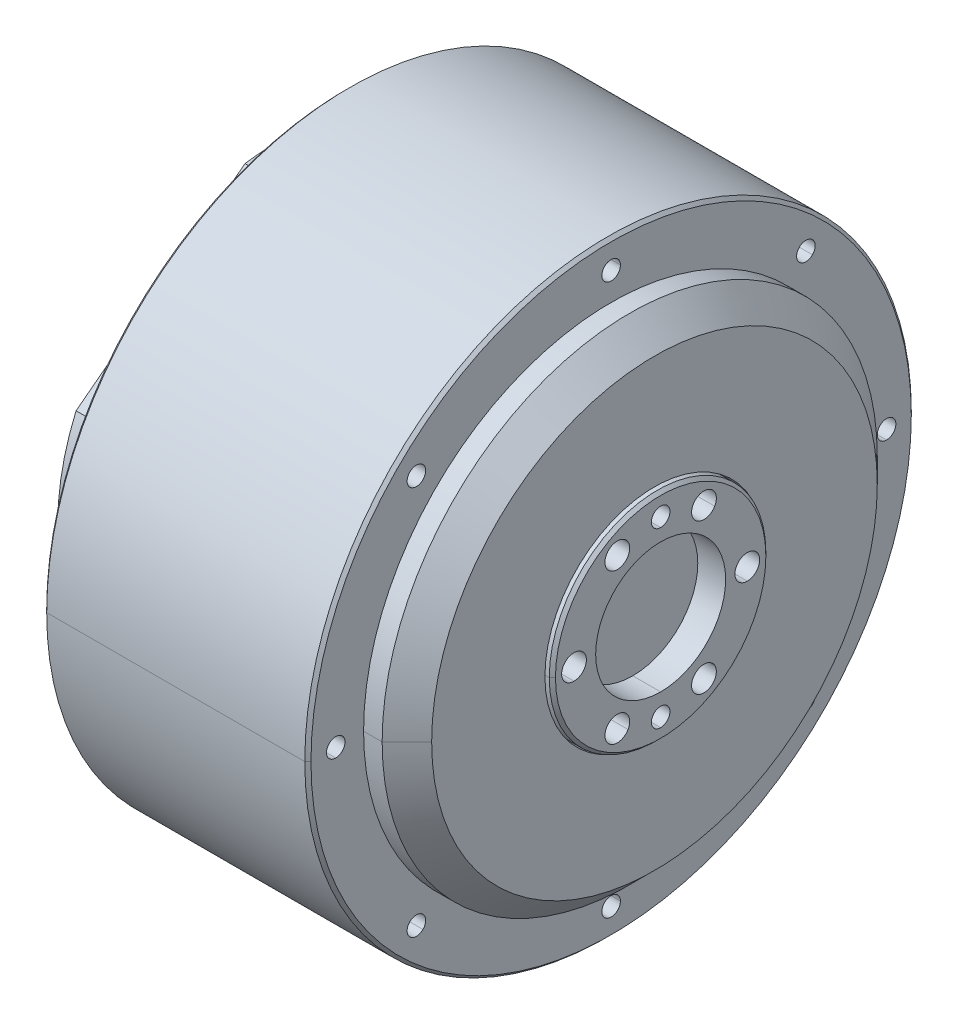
ISO-10303-21;
HEADER;
FILE_DESCRIPTION(('STEP AP214'),'2;1');
FILE_NAME('part.step','',(''),(''),'','','');
FILE_SCHEMA(('AUTOMOTIVE_DESIGN { 1 0 10303 214 1 1 1 1 }'));
ENDSEC;
DATA;
#1=APPLICATION_CONTEXT('core data for automotive mechanical design processes');
#2=APPLICATION_PROTOCOL_DEFINITION('international standard','automotive_design',2000,#1);
#3=PRODUCT_CONTEXT('',#1,'mechanical');
#4=PRODUCT('Part','Part','',(#3));
#5=PRODUCT_RELATED_PRODUCT_CATEGORY('part','',(#4));
#6=PRODUCT_DEFINITION_FORMATION('','',#4);
#7=PRODUCT_DEFINITION_CONTEXT('part definition',#1,'design');
#8=PRODUCT_DEFINITION('design','',#6,#7);
#9=PRODUCT_DEFINITION_SHAPE('','',#8);
#10=(LENGTH_UNIT() NAMED_UNIT(*) SI_UNIT(.MILLI.,.METRE.));
#11=(NAMED_UNIT(*) PLANE_ANGLE_UNIT() SI_UNIT($,.RADIAN.));
#12=(NAMED_UNIT(*) SI_UNIT($,.STERADIAN.) SOLID_ANGLE_UNIT());
#13=UNCERTAINTY_MEASURE_WITH_UNIT(LENGTH_MEASURE(1.E-05),#10,'distance_accuracy_value','');
#14=(GEOMETRIC_REPRESENTATION_CONTEXT(3) GLOBAL_UNCERTAINTY_ASSIGNED_CONTEXT((#13)) GLOBAL_UNIT_ASSIGNED_CONTEXT((#10,
#11,#12)) REPRESENTATION_CONTEXT('',''));
#15=CARTESIAN_POINT('',(0.,0.,0.));
#16=DIRECTION('',(0.,0.,1.));
#17=DIRECTION('',(1.,0.,0.));
#18=AXIS2_PLACEMENT_3D('',#15,#16,#17);
#19=CARTESIAN_POINT('',(0.,-14.,0.));
#20=DIRECTION('',(1.,0.,0.));
#21=DIRECTION('',(0.,1.,0.));
#22=AXIS2_PLACEMENT_3D('',#19,#20,#21);
#23=CYLINDRICAL_SURFACE('',#22,1.5);
#24=DIRECTION('',(-1.,0.,0.));
#25=VECTOR('',#24,1.);
#26=CARTESIAN_POINT('',(0.,-12.5,0.));
#27=LINE('',#26,#25);
#28=CARTESIAN_POINT('',(0.,-12.5,0.));
#29=VERTEX_POINT('',#28);
#30=CARTESIAN_POINT('',(-3.,-12.5,0.));
#31=VERTEX_POINT('',#30);
#32=EDGE_CURVE('E11',#29,#31,#27,.T.);
#33=ORIENTED_EDGE('',*,*,#32,.T.);
#34=CARTESIAN_POINT('',(-3.,-14.,0.));
#35=DIRECTION('',(1.,0.,0.));
#36=DIRECTION('',(0.,-1.,0.));
#37=AXIS2_PLACEMENT_3D('',#34,#35,#36);
#38=CIRCLE('',#37,1.5);
#39=CARTESIAN_POINT('',(-3.,-15.5,0.));
#40=VERTEX_POINT('',#39);
#41=EDGE_CURVE('E1192',#40,#31,#38,.T.);
#42=ORIENTED_EDGE('',*,*,#41,.F.);
#43=DIRECTION('',(-1.,0.,0.));
#44=VECTOR('',#43,1.);
#45=CARTESIAN_POINT('',(0.,-15.5,0.));
#46=LINE('',#45,#44);
#47=CARTESIAN_POINT('',(0.,-15.5,0.));
#48=VERTEX_POINT('',#47);
#49=EDGE_CURVE('E26',#48,#40,#46,.T.);
#50=ORIENTED_EDGE('',*,*,#49,.F.);
#51=CARTESIAN_POINT('',(0.,-14.,0.));
#52=DIRECTION('',(1.,0.,0.));
#53=DIRECTION('',(0.,-1.,0.));
#54=AXIS2_PLACEMENT_3D('',#51,#52,#53);
#55=CIRCLE('',#54,1.5);
#56=EDGE_CURVE('E873',#48,#29,#55,.T.);
#57=ORIENTED_EDGE('',*,*,#56,.T.);
#58=EDGE_LOOP('',(#33,#42,#50,#57));
#59=FACE_BOUND('',#58,.T.);
#60=ADVANCED_FACE('F17',(#59),#23,.F.);
#61=CARTESIAN_POINT('',(0.,-14.,0.));
#62=DIRECTION('',(1.,0.,0.));
#63=DIRECTION('',(0.,1.,0.));
#64=AXIS2_PLACEMENT_3D('',#61,#62,#63);
#65=CYLINDRICAL_SURFACE('',#64,1.5);
#66=ORIENTED_EDGE('',*,*,#49,.T.);
#67=CARTESIAN_POINT('',(-3.,-14.,0.));
#68=DIRECTION('',(1.,0.,0.));
#69=DIRECTION('',(0.,1.,0.));
#70=AXIS2_PLACEMENT_3D('',#67,#68,#69);
#71=CIRCLE('',#70,1.5);
#72=EDGE_CURVE('E1196',#31,#40,#71,.T.);
#73=ORIENTED_EDGE('',*,*,#72,.F.);
#74=ORIENTED_EDGE('',*,*,#32,.F.);
#75=CARTESIAN_POINT('',(0.,-14.,0.));
#76=DIRECTION('',(1.,0.,0.));
#77=DIRECTION('',(0.,1.,0.));
#78=AXIS2_PLACEMENT_3D('',#75,#76,#77);
#79=CIRCLE('',#78,1.5);
#80=EDGE_CURVE('E876',#29,#48,#79,.T.);
#81=ORIENTED_EDGE('',*,*,#80,.T.);
#82=EDGE_LOOP('',(#66,#73,#74,#81));
#83=FACE_BOUND('',#82,.T.);
#84=ADVANCED_FACE('F1824',(#83),#65,.F.);
#85=CARTESIAN_POINT('',(-3.,0.,0.));
#86=DIRECTION('',(1.,0.,0.));
#87=DIRECTION('',(0.,1.,0.));
#88=AXIS2_PLACEMENT_3D('',#85,#86,#87);
#89=PLANE('',#88);
#90=ORIENTED_EDGE('',*,*,#41,.T.);
#91=ORIENTED_EDGE('',*,*,#72,.T.);
#92=EDGE_LOOP('',(#90,#91));
#93=FACE_BOUND('',#92,.T.);
#94=ADVANCED_FACE('F19',(#93),#89,.T.);
#95=CARTESIAN_POINT('',(-3.,0.,0.));
#96=DIRECTION('',(1.,0.,0.));
#97=DIRECTION('',(0.,1.,0.));
#98=AXIS2_PLACEMENT_3D('',#95,#96,#97);
#99=PLANE('',#98);
#100=CARTESIAN_POINT('',(-3.,14.,0.));
#101=DIRECTION('',(1.,0.,0.));
#102=DIRECTION('',(0.,-1.,0.));
#103=AXIS2_PLACEMENT_3D('',#100,#101,#102);
#104=CIRCLE('',#103,1.5);
#105=CARTESIAN_POINT('',(-3.,12.5,0.));
#106=VERTEX_POINT('',#105);
#107=CARTESIAN_POINT('',(-3.,15.5,0.));
#108=VERTEX_POINT('',#107);
#109=EDGE_CURVE('E1189',#106,#108,#104,.T.);
#110=ORIENTED_EDGE('',*,*,#109,.T.);
#111=CARTESIAN_POINT('',(-3.,14.,0.));
#112=DIRECTION('',(1.,0.,0.));
#113=DIRECTION('',(0.,1.,0.));
#114=AXIS2_PLACEMENT_3D('',#111,#112,#113);
#115=CIRCLE('',#114,1.5);
#116=EDGE_CURVE('E1181',#108,#106,#115,.T.);
#117=ORIENTED_EDGE('',*,*,#116,.T.);
#118=EDGE_LOOP('',(#110,#117));
#119=FACE_BOUND('',#118,.T.);
#120=ADVANCED_FACE('F1969',(#119),#99,.T.);
#121=CARTESIAN_POINT('',(0.,14.,0.));
#122=DIRECTION('',(1.,0.,0.));
#123=DIRECTION('',(0.,1.,0.));
#124=AXIS2_PLACEMENT_3D('',#121,#122,#123);
#125=CYLINDRICAL_SURFACE('',#124,1.5);
#126=DIRECTION('',(-1.,0.,0.));
#127=VECTOR('',#126,1.);
#128=CARTESIAN_POINT('',(0.,15.5,0.));
#129=LINE('',#128,#127);
#130=CARTESIAN_POINT('',(0.,15.5,0.));
#131=VERTEX_POINT('',#130);
#132=EDGE_CURVE('E1185',#131,#108,#129,.T.);
#133=ORIENTED_EDGE('',*,*,#132,.T.);
#134=ORIENTED_EDGE('',*,*,#109,.F.);
#135=DIRECTION('',(-1.,0.,0.));
#136=VECTOR('',#135,1.);
#137=CARTESIAN_POINT('',(0.,12.5,0.));
#138=LINE('',#137,#136);
#139=CARTESIAN_POINT('',(0.,12.5,0.));
#140=VERTEX_POINT('',#139);
#141=EDGE_CURVE('E1177',#140,#106,#138,.T.);
#142=ORIENTED_EDGE('',*,*,#141,.F.);
#143=CARTESIAN_POINT('',(0.,14.,0.));
#144=DIRECTION('',(1.,0.,0.));
#145=DIRECTION('',(0.,-1.,0.));
#146=AXIS2_PLACEMENT_3D('',#143,#144,#145);
#147=CIRCLE('',#146,1.5);
#148=EDGE_CURVE('E1108',#140,#131,#147,.T.);
#149=ORIENTED_EDGE('',*,*,#148,.T.);
#150=EDGE_LOOP('',(#133,#134,#142,#149));
#151=FACE_BOUND('',#150,.T.);
#152=ADVANCED_FACE('F1911',(#151),#125,.F.);
#153=CARTESIAN_POINT('',(0.,14.,0.));
#154=DIRECTION('',(1.,0.,0.));
#155=DIRECTION('',(0.,1.,0.));
#156=AXIS2_PLACEMENT_3D('',#153,#154,#155);
#157=CYLINDRICAL_SURFACE('',#156,1.5);
#158=ORIENTED_EDGE('',*,*,#141,.T.);
#159=ORIENTED_EDGE('',*,*,#116,.F.);
#160=ORIENTED_EDGE('',*,*,#132,.F.);
#161=CARTESIAN_POINT('',(0.,14.,0.));
#162=DIRECTION('',(1.,0.,0.));
#163=DIRECTION('',(0.,1.,0.));
#164=AXIS2_PLACEMENT_3D('',#161,#162,#163);
#165=CIRCLE('',#164,1.5);
#166=EDGE_CURVE('E877',#131,#140,#165,.T.);
#167=ORIENTED_EDGE('',*,*,#166,.T.);
#168=EDGE_LOOP('',(#158,#159,#160,#167));
#169=FACE_BOUND('',#168,.T.);
#170=ADVANCED_FACE('F1946',(#169),#157,.F.);
#171=CARTESIAN_POINT('',(-8.,0.,0.));
#172=DIRECTION('',(1.,0.,0.));
#173=DIRECTION('',(0.,1.,0.));
#174=AXIS2_PLACEMENT_3D('',#171,#172,#173);
#175=PLANE('',#174);
#176=CARTESIAN_POINT('',(-8.,0.,14.));
#177=DIRECTION('',(-1.,0.,0.));
#178=DIRECTION('',(0.,1.,0.));
#179=AXIS2_PLACEMENT_3D('',#176,#177,#178);
#180=CIRCLE('',#179,2.);
#181=CARTESIAN_POINT('',(-8.,2.,14.));
#182=VERTEX_POINT('',#181);
#183=CARTESIAN_POINT('',(-8.,-2.,14.));
#184=VERTEX_POINT('',#183);
#185=EDGE_CURVE('E1174',#182,#184,#180,.T.);
#186=ORIENTED_EDGE('',*,*,#185,.F.);
#187=CARTESIAN_POINT('',(-8.,0.,14.));
#188=DIRECTION('',(-1.,0.,0.));
#189=DIRECTION('',(0.,-1.,0.));
#190=AXIS2_PLACEMENT_3D('',#187,#188,#189);
#191=CIRCLE('',#190,2.);
#192=EDGE_CURVE('E739',#184,#182,#191,.T.);
#193=ORIENTED_EDGE('',*,*,#192,.F.);
#194=EDGE_LOOP('',(#186,#193));
#195=FACE_BOUND('',#194,.T.);
#196=ADVANCED_FACE('F1942',(#195),#175,.T.);
#197=CARTESIAN_POINT('',(0.,0.,14.));
#198=DIRECTION('',(1.,0.,0.));
#199=DIRECTION('',(0.,1.,0.));
#200=AXIS2_PLACEMENT_3D('',#197,#198,#199);
#201=CYLINDRICAL_SURFACE('',#200,2.);
#202=DIRECTION('',(-1.,0.,0.));
#203=VECTOR('',#202,1.);
#204=CARTESIAN_POINT('',(0.,2.,14.));
#205=LINE('',#204,#203);
#206=CARTESIAN_POINT('',(0.,2.,14.));
#207=VERTEX_POINT('',#206);
#208=EDGE_CURVE('E743',#207,#182,#205,.T.);
#209=ORIENTED_EDGE('',*,*,#208,.T.);
#210=ORIENTED_EDGE('',*,*,#185,.T.);
#211=DIRECTION('',(-1.,0.,0.));
#212=VECTOR('',#211,1.);
#213=CARTESIAN_POINT('',(0.,-2.,14.));
#214=LINE('',#213,#212);
#215=CARTESIAN_POINT('',(0.,-2.,14.));
#216=VERTEX_POINT('',#215);
#217=EDGE_CURVE('E744',#216,#184,#214,.T.);
#218=ORIENTED_EDGE('',*,*,#217,.F.);
#219=CARTESIAN_POINT('',(0.,0.,14.));
#220=DIRECTION('',(1.,0.,0.));
#221=DIRECTION('',(0.,-1.,0.));
#222=AXIS2_PLACEMENT_3D('',#219,#220,#221);
#223=CIRCLE('',#222,2.);
#224=EDGE_CURVE('E1100',#216,#207,#223,.T.);
#225=ORIENTED_EDGE('',*,*,#224,.T.);
#226=EDGE_LOOP('',(#209,#210,#218,#225));
#227=FACE_BOUND('',#226,.T.);
#228=ADVANCED_FACE('F1945',(#227),#201,.F.);
#229=CARTESIAN_POINT('',(0.,0.,14.));
#230=DIRECTION('',(1.,0.,0.));
#231=DIRECTION('',(0.,1.,0.));
#232=AXIS2_PLACEMENT_3D('',#229,#230,#231);
#233=CYLINDRICAL_SURFACE('',#232,2.);
#234=ORIENTED_EDGE('',*,*,#217,.T.);
#235=ORIENTED_EDGE('',*,*,#192,.T.);
#236=ORIENTED_EDGE('',*,*,#208,.F.);
#237=CARTESIAN_POINT('',(0.,0.,14.));
#238=DIRECTION('',(1.,0.,0.));
#239=DIRECTION('',(0.,1.,0.));
#240=AXIS2_PLACEMENT_3D('',#237,#238,#239);
#241=CIRCLE('',#240,2.);
#242=EDGE_CURVE('E1104',#207,#216,#241,.T.);
#243=ORIENTED_EDGE('',*,*,#242,.T.);
#244=EDGE_LOOP('',(#234,#235,#236,#243));
#245=FACE_BOUND('',#244,.T.);
#246=ADVANCED_FACE('F2187',(#245),#233,.F.);
#247=CARTESIAN_POINT('',(-4.5,0.,0.));
#248=DIRECTION('',(1.,0.,0.));
#249=DIRECTION('',(0.,1.,0.));
#250=AXIS2_PLACEMENT_3D('',#247,#248,#249);
#251=PLANE('',#250);
#252=CARTESIAN_POINT('',(-4.5,0.,0.));
#253=DIRECTION('',(-1.,0.,0.));
#254=DIRECTION('',(0.,1.,0.));
#255=AXIS2_PLACEMENT_3D('',#252,#253,#254);
#256=CIRCLE('',#255,10.5);
#257=CARTESIAN_POINT('',(-4.5,10.5,0.));
#258=VERTEX_POINT('',#257);
#259=CARTESIAN_POINT('',(-4.5,-10.5,0.));
#260=VERTEX_POINT('',#259);
#261=EDGE_CURVE('E732',#258,#260,#256,.T.);
#262=ORIENTED_EDGE('',*,*,#261,.F.);
#263=CARTESIAN_POINT('',(-4.5,0.,0.));
#264=DIRECTION('',(-1.,0.,0.));
#265=DIRECTION('',(0.,-1.,0.));
#266=AXIS2_PLACEMENT_3D('',#263,#264,#265);
#267=CIRCLE('',#266,10.5);
#268=EDGE_CURVE('E733',#260,#258,#267,.T.);
#269=ORIENTED_EDGE('',*,*,#268,.F.);
#270=EDGE_LOOP('',(#262,#269));
#271=FACE_BOUND('',#270,.T.);
#272=ADVANCED_FACE('F1918',(#271),#251,.T.);
#273=CARTESIAN_POINT('',(0.,0.,0.));
#274=DIRECTION('',(1.,0.,0.));
#275=DIRECTION('',(0.,1.,0.));
#276=AXIS2_PLACEMENT_3D('',#273,#274,#275);
#277=CYLINDRICAL_SURFACE('',#276,10.5);
#278=DIRECTION('',(-1.,0.,0.));
#279=VECTOR('',#278,1.);
#280=CARTESIAN_POINT('',(0.,10.5,0.));
#281=LINE('',#280,#279);
#282=CARTESIAN_POINT('',(0.,10.5,0.));
#283=VERTEX_POINT('',#282);
#284=EDGE_CURVE('E728',#283,#258,#281,.T.);
#285=ORIENTED_EDGE('',*,*,#284,.T.);
#286=ORIENTED_EDGE('',*,*,#261,.T.);
#287=DIRECTION('',(-1.,0.,0.));
#288=VECTOR('',#287,1.);
#289=CARTESIAN_POINT('',(0.,-10.5,0.));
#290=LINE('',#289,#288);
#291=CARTESIAN_POINT('',(0.,-10.5,0.));
#292=VERTEX_POINT('',#291);
#293=EDGE_CURVE('E978',#292,#260,#290,.T.);
#294=ORIENTED_EDGE('',*,*,#293,.F.);
#295=CARTESIAN_POINT('',(0.,0.,0.));
#296=DIRECTION('',(1.,0.,0.));
#297=DIRECTION('',(0.,-1.,0.));
#298=AXIS2_PLACEMENT_3D('',#295,#296,#297);
#299=CIRCLE('',#298,10.5);
#300=EDGE_CURVE('E961',#292,#283,#299,.T.);
#301=ORIENTED_EDGE('',*,*,#300,.T.);
#302=EDGE_LOOP('',(#285,#286,#294,#301));
#303=FACE_BOUND('',#302,.T.);
#304=ADVANCED_FACE('F1914',(#303),#277,.F.);
#305=CARTESIAN_POINT('',(0.,0.,0.));
#306=DIRECTION('',(1.,0.,0.));
#307=DIRECTION('',(0.,1.,0.));
#308=AXIS2_PLACEMENT_3D('',#305,#306,#307);
#309=CYLINDRICAL_SURFACE('',#308,10.5);
#310=ORIENTED_EDGE('',*,*,#293,.T.);
#311=ORIENTED_EDGE('',*,*,#268,.T.);
#312=ORIENTED_EDGE('',*,*,#284,.F.);
#313=CARTESIAN_POINT('',(0.,0.,0.));
#314=DIRECTION('',(1.,0.,0.));
#315=DIRECTION('',(0.,1.,0.));
#316=AXIS2_PLACEMENT_3D('',#313,#314,#315);
#317=CIRCLE('',#316,10.5);
#318=EDGE_CURVE('E1096',#283,#292,#317,.T.);
#319=ORIENTED_EDGE('',*,*,#318,.T.);
#320=EDGE_LOOP('',(#310,#311,#312,#319));
#321=FACE_BOUND('',#320,.T.);
#322=ADVANCED_FACE('F1917',(#321),#309,.F.);
#323=CARTESIAN_POINT('',(-8.,0.,0.));
#324=DIRECTION('',(1.,0.,0.));
#325=DIRECTION('',(0.,1.,0.));
#326=AXIS2_PLACEMENT_3D('',#323,#324,#325);
#327=PLANE('',#326);
#328=CARTESIAN_POINT('',(-8.,12.12435565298,7.));
#329=DIRECTION('',(-1.,0.,0.));
#330=DIRECTION('',(0.,0.500000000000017,-0.866025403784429));
#331=AXIS2_PLACEMENT_3D('',#328,#329,#330);
#332=CIRCLE('',#331,2.);
#333=CARTESIAN_POINT('',(-8.,13.12435565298,5.267949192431));
#334=VERTEX_POINT('',#333);
#335=CARTESIAN_POINT('',(-8.,11.12435565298,8.732050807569));
#336=VERTEX_POINT('',#335);
#337=EDGE_CURVE('E917',#334,#336,#332,.T.);
#338=ORIENTED_EDGE('',*,*,#337,.F.);
#339=CARTESIAN_POINT('',(-8.,12.12435565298,7.));
#340=DIRECTION('',(-1.,0.,0.));
#341=DIRECTION('',(0.,-0.500000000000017,0.866025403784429));
#342=AXIS2_PLACEMENT_3D('',#339,#340,#341);
#343=CIRCLE('',#342,2.);
#344=EDGE_CURVE('E884',#336,#334,#343,.T.);
#345=ORIENTED_EDGE('',*,*,#344,.F.);
#346=EDGE_LOOP('',(#338,#345));
#347=FACE_BOUND('',#346,.T.);
#348=ADVANCED_FACE('F2055',(#347),#327,.T.);
#349=CARTESIAN_POINT('',(0.,12.12435565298,7.));
#350=DIRECTION('',(1.,0.,0.));
#351=DIRECTION('',(0.,0.500000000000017,-0.866025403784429));
#352=AXIS2_PLACEMENT_3D('',#349,#350,#351);
#353=CYLINDRICAL_SURFACE('',#352,2.);
#354=DIRECTION('',(-1.,0.,0.));
#355=VECTOR('',#354,1.);
#356=CARTESIAN_POINT('',(0.,13.12435565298,5.267949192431));
#357=LINE('',#356,#355);
#358=CARTESIAN_POINT('',(0.,13.12435565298,5.267949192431));
#359=VERTEX_POINT('',#358);
#360=EDGE_CURVE('E888',#359,#334,#357,.T.);
#361=ORIENTED_EDGE('',*,*,#360,.T.);
#362=ORIENTED_EDGE('',*,*,#337,.T.);
#363=DIRECTION('',(-1.,0.,0.));
#364=VECTOR('',#363,1.);
#365=CARTESIAN_POINT('',(0.,11.12435565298,8.732050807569));
#366=LINE('',#365,#364);
#367=CARTESIAN_POINT('',(0.,11.12435565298,8.732050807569));
#368=VERTEX_POINT('',#367);
#369=EDGE_CURVE('E889',#368,#336,#366,.T.);
#370=ORIENTED_EDGE('',*,*,#369,.F.);
#371=CARTESIAN_POINT('',(0.,12.12435565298,7.));
#372=DIRECTION('',(1.,0.,0.));
#373=DIRECTION('',(0.,-0.500000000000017,0.866025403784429));
#374=AXIS2_PLACEMENT_3D('',#371,#372,#373);
#375=CIRCLE('',#374,2.);
#376=EDGE_CURVE('E962',#368,#359,#375,.T.);
#377=ORIENTED_EDGE('',*,*,#376,.T.);
#378=EDGE_LOOP('',(#361,#362,#370,#377));
#379=FACE_BOUND('',#378,.T.);
#380=ADVANCED_FACE('F2052',(#379),#353,.F.);
#381=CARTESIAN_POINT('',(0.,12.12435565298,7.));
#382=DIRECTION('',(1.,0.,0.));
#383=DIRECTION('',(0.,0.500000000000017,-0.866025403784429));
#384=AXIS2_PLACEMENT_3D('',#381,#382,#383);
#385=CYLINDRICAL_SURFACE('',#384,2.);
#386=ORIENTED_EDGE('',*,*,#369,.T.);
#387=ORIENTED_EDGE('',*,*,#344,.T.);
#388=ORIENTED_EDGE('',*,*,#360,.F.);
#389=CARTESIAN_POINT('',(0.,12.12435565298,7.));
#390=DIRECTION('',(1.,0.,0.));
#391=DIRECTION('',(0.,0.500000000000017,-0.866025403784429));
#392=AXIS2_PLACEMENT_3D('',#389,#390,#391);
#393=CIRCLE('',#392,2.);
#394=EDGE_CURVE('E957',#359,#368,#393,.T.);
#395=ORIENTED_EDGE('',*,*,#394,.T.);
#396=EDGE_LOOP('',(#386,#387,#388,#395));
#397=FACE_BOUND('',#396,.T.);
#398=ADVANCED_FACE('F1977',(#397),#385,.F.);
#399=CARTESIAN_POINT('',(-8.,0.,0.));
#400=DIRECTION('',(1.,0.,0.));
#401=DIRECTION('',(0.,1.,0.));
#402=AXIS2_PLACEMENT_3D('',#399,#400,#401);
#403=PLANE('',#402);
#404=CARTESIAN_POINT('',(-8.,12.12435565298,-7.));
#405=DIRECTION('',(-1.,0.,0.));
#406=DIRECTION('',(0.,-0.500000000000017,-0.866025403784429));
#407=AXIS2_PLACEMENT_3D('',#404,#405,#406);
#408=CIRCLE('',#407,2.);
#409=CARTESIAN_POINT('',(-8.,11.12435565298,-8.732050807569));
#410=VERTEX_POINT('',#409);
#411=CARTESIAN_POINT('',(-8.,13.12435565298,-5.267949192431));
#412=VERTEX_POINT('',#411);
#413=EDGE_CURVE('E1159',#410,#412,#408,.T.);
#414=ORIENTED_EDGE('',*,*,#413,.F.);
#415=CARTESIAN_POINT('',(-8.,12.12435565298,-7.));
#416=DIRECTION('',(-1.,0.,0.));
#417=DIRECTION('',(0.,0.500000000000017,0.866025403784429));
#418=AXIS2_PLACEMENT_3D('',#415,#416,#417);
#419=CIRCLE('',#418,2.);
#420=EDGE_CURVE('E1151',#412,#410,#419,.T.);
#421=ORIENTED_EDGE('',*,*,#420,.F.);
#422=EDGE_LOOP('',(#414,#421));
#423=FACE_BOUND('',#422,.T.);
#424=ADVANCED_FACE('F1973',(#423),#403,.T.);
#425=CARTESIAN_POINT('',(0.,12.12435565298,-7.));
#426=DIRECTION('',(1.,0.,0.));
#427=DIRECTION('',(0.,-0.500000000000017,-0.866025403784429));
#428=AXIS2_PLACEMENT_3D('',#425,#426,#427);
#429=CYLINDRICAL_SURFACE('',#428,2.);
#430=DIRECTION('',(-1.,0.,0.));
#431=VECTOR('',#430,1.);
#432=CARTESIAN_POINT('',(0.,11.12435565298,-8.732050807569));
#433=LINE('',#432,#431);
#434=CARTESIAN_POINT('',(0.,11.12435565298,-8.732050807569));
#435=VERTEX_POINT('',#434);
#436=EDGE_CURVE('E1155',#435,#410,#433,.T.);
#437=ORIENTED_EDGE('',*,*,#436,.T.);
#438=ORIENTED_EDGE('',*,*,#413,.T.);
#439=DIRECTION('',(-1.,0.,0.));
#440=VECTOR('',#439,1.);
#441=CARTESIAN_POINT('',(0.,13.12435565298,-5.267949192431));
#442=LINE('',#441,#440);
#443=CARTESIAN_POINT('',(0.,13.12435565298,-5.267949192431));
#444=VERTEX_POINT('',#443);
#445=EDGE_CURVE('E1147',#444,#412,#442,.T.);
#446=ORIENTED_EDGE('',*,*,#445,.F.);
#447=CARTESIAN_POINT('',(0.,12.12435565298,-7.));
#448=DIRECTION('',(1.,0.,0.));
#449=DIRECTION('',(0.,0.500000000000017,0.866025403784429));
#450=AXIS2_PLACEMENT_3D('',#447,#448,#449);
#451=CIRCLE('',#450,2.);
#452=EDGE_CURVE('E835',#444,#435,#451,.T.);
#453=ORIENTED_EDGE('',*,*,#452,.T.);
#454=EDGE_LOOP('',(#437,#438,#446,#453));
#455=FACE_BOUND('',#454,.T.);
#456=ADVANCED_FACE('F1976',(#455),#429,.F.);
#457=CARTESIAN_POINT('',(0.,12.12435565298,-7.));
#458=DIRECTION('',(1.,0.,0.));
#459=DIRECTION('',(0.,-0.500000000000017,-0.866025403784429));
#460=AXIS2_PLACEMENT_3D('',#457,#458,#459);
#461=CYLINDRICAL_SURFACE('',#460,2.);
#462=ORIENTED_EDGE('',*,*,#445,.T.);
#463=ORIENTED_EDGE('',*,*,#420,.T.);
#464=ORIENTED_EDGE('',*,*,#436,.F.);
#465=CARTESIAN_POINT('',(0.,12.12435565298,-7.));
#466=DIRECTION('',(1.,0.,0.));
#467=DIRECTION('',(0.,-0.500000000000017,-0.866025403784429));
#468=AXIS2_PLACEMENT_3D('',#465,#466,#467);
#469=CIRCLE('',#468,2.);
#470=EDGE_CURVE('E1086',#435,#444,#469,.T.);
#471=ORIENTED_EDGE('',*,*,#470,.T.);
#472=EDGE_LOOP('',(#462,#463,#464,#471));
#473=FACE_BOUND('',#472,.T.);
#474=ADVANCED_FACE('F1952',(#473),#461,.F.);
#475=CARTESIAN_POINT('',(-8.,0.,0.));
#476=DIRECTION('',(1.,0.,0.));
#477=DIRECTION('',(0.,1.,0.));
#478=AXIS2_PLACEMENT_3D('',#475,#476,#477);
#479=PLANE('',#478);
#480=CARTESIAN_POINT('',(-8.,0.,-14.));
#481=DIRECTION('',(-1.,0.,0.));
#482=DIRECTION('',(0.,-1.,0.));
#483=AXIS2_PLACEMENT_3D('',#480,#481,#482);
#484=CIRCLE('',#483,2.);
#485=CARTESIAN_POINT('',(-8.,-2.,-14.));
#486=VERTEX_POINT('',#485);
#487=CARTESIAN_POINT('',(-8.,2.,-14.));
#488=VERTEX_POINT('',#487);
#489=EDGE_CURVE('E1144',#486,#488,#484,.T.);
#490=ORIENTED_EDGE('',*,*,#489,.F.);
#491=CARTESIAN_POINT('',(-8.,0.,-14.));
#492=DIRECTION('',(-1.,0.,0.));
#493=DIRECTION('',(0.,1.,0.));
#494=AXIS2_PLACEMENT_3D('',#491,#492,#493);
#495=CIRCLE('',#494,2.);
#496=EDGE_CURVE('E653',#488,#486,#495,.T.);
#497=ORIENTED_EDGE('',*,*,#496,.F.);
#498=EDGE_LOOP('',(#490,#497));
#499=FACE_BOUND('',#498,.T.);
#500=ADVANCED_FACE('F1948',(#499),#479,.T.);
#501=CARTESIAN_POINT('',(0.,0.,-14.));
#502=DIRECTION('',(1.,0.,0.));
#503=DIRECTION('',(0.,-1.,0.));
#504=AXIS2_PLACEMENT_3D('',#501,#502,#503);
#505=CYLINDRICAL_SURFACE('',#504,2.);
#506=DIRECTION('',(-1.,0.,0.));
#507=VECTOR('',#506,1.);
#508=CARTESIAN_POINT('',(0.,-2.,-14.));
#509=LINE('',#508,#507);
#510=CARTESIAN_POINT('',(0.,-2.,-14.));
#511=VERTEX_POINT('',#510);
#512=EDGE_CURVE('E830',#511,#486,#509,.T.);
#513=ORIENTED_EDGE('',*,*,#512,.T.);
#514=ORIENTED_EDGE('',*,*,#489,.T.);
#515=DIRECTION('',(-1.,0.,0.));
#516=VECTOR('',#515,1.);
#517=CARTESIAN_POINT('',(0.,2.,-14.));
#518=LINE('',#517,#516);
#519=CARTESIAN_POINT('',(0.,2.,-14.));
#520=VERTEX_POINT('',#519);
#521=EDGE_CURVE('E649',#520,#488,#518,.T.);
#522=ORIENTED_EDGE('',*,*,#521,.F.);
#523=CARTESIAN_POINT('',(0.,0.,-14.));
#524=DIRECTION('',(1.,0.,0.));
#525=DIRECTION('',(0.,1.,0.));
#526=AXIS2_PLACEMENT_3D('',#523,#524,#525);
#527=CIRCLE('',#526,2.);
#528=EDGE_CURVE('E836',#520,#511,#527,.T.);
#529=ORIENTED_EDGE('',*,*,#528,.T.);
#530=EDGE_LOOP('',(#513,#514,#522,#529));
#531=FACE_BOUND('',#530,.T.);
#532=ADVANCED_FACE('F1951',(#531),#505,.F.);
#533=CARTESIAN_POINT('',(0.,0.,-14.));
#534=DIRECTION('',(1.,0.,0.));
#535=DIRECTION('',(0.,-1.,0.));
#536=AXIS2_PLACEMENT_3D('',#533,#534,#535);
#537=CYLINDRICAL_SURFACE('',#536,2.);
#538=ORIENTED_EDGE('',*,*,#521,.T.);
#539=ORIENTED_EDGE('',*,*,#496,.T.);
#540=ORIENTED_EDGE('',*,*,#512,.F.);
#541=CARTESIAN_POINT('',(0.,0.,-14.));
#542=DIRECTION('',(1.,0.,0.));
#543=DIRECTION('',(0.,-1.,0.));
#544=AXIS2_PLACEMENT_3D('',#541,#542,#543);
#545=CIRCLE('',#544,2.);
#546=EDGE_CURVE('E831',#511,#520,#545,.T.);
#547=ORIENTED_EDGE('',*,*,#546,.T.);
#548=EDGE_LOOP('',(#538,#539,#540,#547));
#549=FACE_BOUND('',#548,.T.);
#550=ADVANCED_FACE('F2169',(#549),#537,.F.);
#551=CARTESIAN_POINT('',(-8.,0.,0.));
#552=DIRECTION('',(1.,0.,0.));
#553=DIRECTION('',(0.,1.,0.));
#554=AXIS2_PLACEMENT_3D('',#551,#552,#553);
#555=PLANE('',#554);
#556=CARTESIAN_POINT('',(-8.,-12.12435565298,-7.));
#557=DIRECTION('',(-1.,0.,0.));
#558=DIRECTION('',(0.,-0.500000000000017,0.866025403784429));
#559=AXIS2_PLACEMENT_3D('',#556,#557,#558);
#560=CIRCLE('',#559,2.);
#561=CARTESIAN_POINT('',(-8.,-13.12435565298,-5.267949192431));
#562=VERTEX_POINT('',#561);
#563=CARTESIAN_POINT('',(-8.,-11.12435565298,-8.732050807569));
#564=VERTEX_POINT('',#563);
#565=EDGE_CURVE('E654',#562,#564,#560,.T.);
#566=ORIENTED_EDGE('',*,*,#565,.F.);
#567=CARTESIAN_POINT('',(-8.,-12.12435565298,-7.));
#568=DIRECTION('',(-1.,0.,0.));
#569=DIRECTION('',(0.,0.500000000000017,-0.866025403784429));
#570=AXIS2_PLACEMENT_3D('',#567,#568,#569);
#571=CIRCLE('',#570,2.);
#572=EDGE_CURVE('E1131',#564,#562,#571,.T.);
#573=ORIENTED_EDGE('',*,*,#572,.F.);
#574=EDGE_LOOP('',(#566,#573));
#575=FACE_BOUND('',#574,.T.);
#576=ADVANCED_FACE('F2003',(#575),#555,.T.);
#577=CARTESIAN_POINT('',(0.,-12.12435565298,-7.));
#578=DIRECTION('',(1.,0.,0.));
#579=DIRECTION('',(0.,-0.500000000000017,0.866025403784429));
#580=AXIS2_PLACEMENT_3D('',#577,#578,#579);
#581=CYLINDRICAL_SURFACE('',#580,2.);
#582=DIRECTION('',(-1.,0.,0.));
#583=VECTOR('',#582,1.);
#584=CARTESIAN_POINT('',(0.,-13.12435565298,-5.267949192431));
#585=LINE('',#584,#583);
#586=CARTESIAN_POINT('',(0.,-13.12435565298,-5.267949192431));
#587=VERTEX_POINT('',#586);
#588=EDGE_CURVE('E1135',#587,#562,#585,.T.);
#589=ORIENTED_EDGE('',*,*,#588,.T.);
#590=ORIENTED_EDGE('',*,*,#565,.T.);
#591=DIRECTION('',(-1.,0.,0.));
#592=VECTOR('',#591,1.);
#593=CARTESIAN_POINT('',(0.,-11.12435565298,-8.732050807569));
#594=LINE('',#593,#592);
#595=CARTESIAN_POINT('',(0.,-11.12435565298,-8.732050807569));
#596=VERTEX_POINT('',#595);
#597=EDGE_CURVE('E794',#596,#564,#594,.T.);
#598=ORIENTED_EDGE('',*,*,#597,.F.);
#599=CARTESIAN_POINT('',(0.,-12.12435565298,-7.));
#600=DIRECTION('',(1.,0.,0.));
#601=DIRECTION('',(0.,0.500000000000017,-0.866025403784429));
#602=AXIS2_PLACEMENT_3D('',#599,#600,#601);
#603=CIRCLE('',#602,2.);
#604=EDGE_CURVE('E760',#596,#587,#603,.T.);
#605=ORIENTED_EDGE('',*,*,#604,.T.);
#606=EDGE_LOOP('',(#589,#590,#598,#605));
#607=FACE_BOUND('',#606,.T.);
#608=ADVANCED_FACE('F1999',(#607),#581,.F.);
#609=CARTESIAN_POINT('',(0.,-12.12435565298,-7.));
#610=DIRECTION('',(1.,0.,0.));
#611=DIRECTION('',(0.,-0.500000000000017,0.866025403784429));
#612=AXIS2_PLACEMENT_3D('',#609,#610,#611);
#613=CYLINDRICAL_SURFACE('',#612,2.);
#614=ORIENTED_EDGE('',*,*,#597,.T.);
#615=ORIENTED_EDGE('',*,*,#572,.T.);
#616=ORIENTED_EDGE('',*,*,#588,.F.);
#617=CARTESIAN_POINT('',(0.,-12.12435565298,-7.));
#618=DIRECTION('',(1.,0.,0.));
#619=DIRECTION('',(0.,-0.500000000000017,0.866025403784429));
#620=AXIS2_PLACEMENT_3D('',#617,#618,#619);
#621=CIRCLE('',#620,2.);
#622=EDGE_CURVE('E764',#587,#596,#621,.T.);
#623=ORIENTED_EDGE('',*,*,#622,.T.);
#624=EDGE_LOOP('',(#614,#615,#616,#623));
#625=FACE_BOUND('',#624,.T.);
#626=ADVANCED_FACE('F2002',(#625),#613,.F.);
#627=CARTESIAN_POINT('',(-8.,0.,0.));
#628=DIRECTION('',(1.,0.,0.));
#629=DIRECTION('',(0.,1.,0.));
#630=AXIS2_PLACEMENT_3D('',#627,#628,#629);
#631=PLANE('',#630);
#632=CARTESIAN_POINT('',(-8.,-12.12435565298,7.));
#633=DIRECTION('',(-1.,0.,0.));
#634=DIRECTION('',(0.,0.500000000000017,0.866025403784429));
#635=AXIS2_PLACEMENT_3D('',#632,#633,#634);
#636=CIRCLE('',#635,2.);
#637=CARTESIAN_POINT('',(-8.,-11.12435565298,8.732050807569));
#638=VERTEX_POINT('',#637);
#639=CARTESIAN_POINT('',(-8.,-13.12435565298,5.267949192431));
#640=VERTEX_POINT('',#639);
#641=EDGE_CURVE('E791',#638,#640,#636,.T.);
#642=ORIENTED_EDGE('',*,*,#641,.F.);
#643=CARTESIAN_POINT('',(-8.,-12.12435565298,7.));
#644=DIRECTION('',(-1.,0.,0.));
#645=DIRECTION('',(0.,-0.500000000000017,-0.866025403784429));
#646=AXIS2_PLACEMENT_3D('',#643,#644,#645);
#647=CIRCLE('',#646,2.);
#648=EDGE_CURVE('E1121',#640,#638,#647,.T.);
#649=ORIENTED_EDGE('',*,*,#648,.F.);
#650=EDGE_LOOP('',(#642,#649));
#651=FACE_BOUND('',#650,.T.);
#652=ADVANCED_FACE('F2162',(#651),#631,.T.);
#653=CARTESIAN_POINT('',(0.,-12.12435565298,7.));
#654=DIRECTION('',(1.,0.,0.));
#655=DIRECTION('',(0.,0.500000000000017,0.866025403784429));
#656=AXIS2_PLACEMENT_3D('',#653,#654,#655);
#657=CYLINDRICAL_SURFACE('',#656,2.);
#658=DIRECTION('',(-1.,0.,0.));
#659=VECTOR('',#658,1.);
#660=CARTESIAN_POINT('',(0.,-11.12435565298,8.732050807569));
#661=LINE('',#660,#659);
#662=CARTESIAN_POINT('',(0.,-11.12435565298,8.732050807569));
#663=VERTEX_POINT('',#662);
#664=EDGE_CURVE('E795',#663,#638,#661,.T.);
#665=ORIENTED_EDGE('',*,*,#664,.T.);
#666=ORIENTED_EDGE('',*,*,#641,.T.);
#667=DIRECTION('',(-1.,0.,0.));
#668=VECTOR('',#667,1.);
#669=CARTESIAN_POINT('',(0.,-13.12435565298,5.267949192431));
#670=LINE('',#669,#668);
#671=CARTESIAN_POINT('',(0.,-13.12435565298,5.267949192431));
#672=VERTEX_POINT('',#671);
#673=EDGE_CURVE('E1117',#672,#640,#670,.T.);
#674=ORIENTED_EDGE('',*,*,#673,.F.);
#675=CARTESIAN_POINT('',(0.,-12.12435565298,7.));
#676=DIRECTION('',(1.,0.,0.));
#677=DIRECTION('',(0.,-0.500000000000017,-0.866025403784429));
#678=AXIS2_PLACEMENT_3D('',#675,#676,#677);
#679=CIRCLE('',#678,2.);
#680=EDGE_CURVE('E1028',#672,#663,#679,.T.);
#681=ORIENTED_EDGE('',*,*,#680,.T.);
#682=EDGE_LOOP('',(#665,#666,#674,#681));
#683=FACE_BOUND('',#682,.T.);
#684=ADVANCED_FACE('F1958',(#683),#657,.F.);
#685=CARTESIAN_POINT('',(0.,-12.12435565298,7.));
#686=DIRECTION('',(1.,0.,0.));
#687=DIRECTION('',(0.,0.500000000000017,0.866025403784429));
#688=AXIS2_PLACEMENT_3D('',#685,#686,#687);
#689=CYLINDRICAL_SURFACE('',#688,2.);
#690=ORIENTED_EDGE('',*,*,#673,.T.);
#691=ORIENTED_EDGE('',*,*,#648,.T.);
#692=ORIENTED_EDGE('',*,*,#664,.F.);
#693=CARTESIAN_POINT('',(0.,-12.12435565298,7.));
#694=DIRECTION('',(1.,0.,0.));
#695=DIRECTION('',(0.,0.500000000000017,0.866025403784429));
#696=AXIS2_PLACEMENT_3D('',#693,#694,#695);
#697=CIRCLE('',#696,2.);
#698=EDGE_CURVE('E765',#663,#672,#697,.T.);
#699=ORIENTED_EDGE('',*,*,#698,.T.);
#700=EDGE_LOOP('',(#690,#691,#692,#699));
#701=FACE_BOUND('',#700,.T.);
#702=ADVANCED_FACE('F1954',(#701),#689,.F.);
#703=CARTESIAN_POINT('',(0.,0.,0.));
#704=DIRECTION('',(1.,0.,0.));
#705=DIRECTION('',(0.,1.,0.));
#706=AXIS2_PLACEMENT_3D('',#703,#704,#705);
#707=PLANE('',#706);
#708=ORIENTED_EDGE('',*,*,#56,.F.);
#709=ORIENTED_EDGE('',*,*,#80,.F.);
#710=EDGE_LOOP('',(#708,#709));
#711=FACE_BOUND('',#710,.T.);
#712=ORIENTED_EDGE('',*,*,#148,.F.);
#713=ORIENTED_EDGE('',*,*,#166,.F.);
#714=EDGE_LOOP('',(#712,#713));
#715=FACE_BOUND('',#714,.T.);
#716=ORIENTED_EDGE('',*,*,#224,.F.);
#717=ORIENTED_EDGE('',*,*,#242,.F.);
#718=EDGE_LOOP('',(#716,#717));
#719=FACE_BOUND('',#718,.T.);
#720=ORIENTED_EDGE('',*,*,#300,.F.);
#721=ORIENTED_EDGE('',*,*,#318,.F.);
#722=EDGE_LOOP('',(#720,#721));
#723=FACE_BOUND('',#722,.T.);
#724=ORIENTED_EDGE('',*,*,#376,.F.);
#725=ORIENTED_EDGE('',*,*,#394,.F.);
#726=EDGE_LOOP('',(#724,#725));
#727=FACE_BOUND('',#726,.T.);
#728=ORIENTED_EDGE('',*,*,#452,.F.);
#729=ORIENTED_EDGE('',*,*,#470,.F.);
#730=EDGE_LOOP('',(#728,#729));
#731=FACE_BOUND('',#730,.T.);
#732=ORIENTED_EDGE('',*,*,#528,.F.);
#733=ORIENTED_EDGE('',*,*,#546,.F.);
#734=EDGE_LOOP('',(#732,#733));
#735=FACE_BOUND('',#734,.T.);
#736=ORIENTED_EDGE('',*,*,#604,.F.);
#737=ORIENTED_EDGE('',*,*,#622,.F.);
#738=EDGE_LOOP('',(#736,#737));
#739=FACE_BOUND('',#738,.T.);
#740=ORIENTED_EDGE('',*,*,#680,.F.);
#741=ORIENTED_EDGE('',*,*,#698,.F.);
#742=EDGE_LOOP('',(#740,#741));
#743=FACE_BOUND('',#742,.T.);
#744=CARTESIAN_POINT('',(-6.927791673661E-13,0.,0.));
#745=DIRECTION('',(-1.,0.,0.));
#746=DIRECTION('',(0.,0.,-1.));
#747=AXIS2_PLACEMENT_3D('',#744,#745,#746);
#748=CIRCLE('',#747,17.);
#749=CARTESIAN_POINT('',(-4.547473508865E-13,0.,-17.));
#750=VERTEX_POINT('',#749);
#751=CARTESIAN_POINT('',(-6.927791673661E-13,0.,17.));
#752=VERTEX_POINT('',#751);
#753=EDGE_CURVE('E1716',#750,#752,#748,.T.);
#754=ORIENTED_EDGE('',*,*,#753,.F.);
#755=CARTESIAN_POINT('',(-6.927791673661E-13,0.,0.));
#756=DIRECTION('',(-1.,0.,0.));
#757=DIRECTION('',(0.,0.,1.));
#758=AXIS2_PLACEMENT_3D('',#755,#756,#757);
#759=CIRCLE('',#758,17.);
#760=EDGE_CURVE('E1724',#752,#750,#759,.T.);
#761=ORIENTED_EDGE('',*,*,#760,.F.);
#762=EDGE_LOOP('',(#754,#761));
#763=FACE_BOUND('',#762,.T.);
#764=ADVANCED_FACE('F1957',(#711,#715,#719,#723,#727,#731,#735,#739,#743,#763),#707,.T.);
#765=CARTESIAN_POINT('',(-1.,0.,0.));
#766=DIRECTION('',(1.,0.,0.));
#767=DIRECTION('',(0.,0.,1.));
#768=AXIS2_PLACEMENT_3D('',#765,#766,#767);
#769=CYLINDRICAL_SURFACE('',#768,17.7);
#770=DIRECTION('',(-1.,0.,0.));
#771=VECTOR('',#770,1.);
#772=CARTESIAN_POINT('',(-1.,0.,17.7));
#773=LINE('',#772,#771);
#774=CARTESIAN_POINT('',(-1.,0.,17.7));
#775=VERTEX_POINT('',#774);
#776=CARTESIAN_POINT('',(-8.5,0.,17.7));
#777=VERTEX_POINT('',#776);
#778=EDGE_CURVE('E1705',#775,#777,#773,.T.);
#779=ORIENTED_EDGE('',*,*,#778,.T.);
#780=CARTESIAN_POINT('',(-8.5,0.,0.));
#781=DIRECTION('',(-1.,0.,0.));
#782=DIRECTION('',(0.,0.,1.));
#783=AXIS2_PLACEMENT_3D('',#780,#781,#782);
#784=CIRCLE('',#783,17.7);
#785=CARTESIAN_POINT('',(-8.5,0.,-17.7));
#786=VERTEX_POINT('',#785);
#787=EDGE_CURVE('E1713',#777,#786,#784,.T.);
#788=ORIENTED_EDGE('',*,*,#787,.T.);
#789=DIRECTION('',(-1.,0.,0.));
#790=VECTOR('',#789,1.);
#791=CARTESIAN_POINT('',(-1.,0.,-17.7));
#792=LINE('',#791,#790);
#793=CARTESIAN_POINT('',(-1.,0.,-17.7));
#794=VERTEX_POINT('',#793);
#795=EDGE_CURVE('E1708',#794,#786,#792,.T.);
#796=ORIENTED_EDGE('',*,*,#795,.F.);
#797=CARTESIAN_POINT('',(-1.,0.,0.));
#798=DIRECTION('',(1.,0.,0.));
#799=DIRECTION('',(0.,0.,-1.));
#800=AXIS2_PLACEMENT_3D('',#797,#798,#799);
#801=CIRCLE('',#800,17.7);
#802=EDGE_CURVE('E1690',#794,#775,#801,.T.);
#803=ORIENTED_EDGE('',*,*,#802,.T.);
#804=EDGE_LOOP('',(#779,#788,#796,#803));
#805=FACE_BOUND('',#804,.T.);
#806=ADVANCED_FACE('F1766',(#805),#769,.F.);
#807=CARTESIAN_POINT('',(-16.,0.,0.));
#808=DIRECTION('',(1.,0.,0.));
#809=DIRECTION('',(0.,1.,0.));
#810=AXIS2_PLACEMENT_3D('',#807,#808,#809);
#811=PLANE('',#810);
#812=CARTESIAN_POINT('',(-16.,31.4662517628,-31.4662517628));
#813=DIRECTION('',(-1.,0.,0.));
#814=DIRECTION('',(0.,-0.707106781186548,-0.707106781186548));
#815=AXIS2_PLACEMENT_3D('',#812,#813,#814);
#816=CIRCLE('',#815,1.5);
#817=CARTESIAN_POINT('',(-16.,30.40559159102,-32.52691193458));
#818=VERTEX_POINT('',#817);
#819=CARTESIAN_POINT('',(-16.,32.52691193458,-30.40559159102));
#820=VERTEX_POINT('',#819);
#821=EDGE_CURVE('E1032',#818,#820,#816,.T.);
#822=ORIENTED_EDGE('',*,*,#821,.F.);
#823=CARTESIAN_POINT('',(-16.,31.4662517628,-31.4662517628));
#824=DIRECTION('',(-1.,0.,0.));
#825=DIRECTION('',(0.,0.707106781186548,0.707106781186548));
#826=AXIS2_PLACEMENT_3D('',#823,#824,#825);
#827=CIRCLE('',#826,1.5);
#828=EDGE_CURVE('E1044',#820,#818,#827,.T.);
#829=ORIENTED_EDGE('',*,*,#828,.F.);
#830=EDGE_LOOP('',(#822,#829));
#831=FACE_BOUND('',#830,.T.);
#832=ADVANCED_FACE('F1936',(#831),#811,.T.);
#833=CARTESIAN_POINT('',(-8.,31.4662517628,-31.4662517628));
#834=DIRECTION('',(1.,0.,0.));
#835=DIRECTION('',(0.,-0.707106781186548,-0.707106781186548));
#836=AXIS2_PLACEMENT_3D('',#833,#834,#835);
#837=CYLINDRICAL_SURFACE('',#836,1.5);
#838=DIRECTION('',(-1.,0.,0.));
#839=VECTOR('',#838,1.);
#840=CARTESIAN_POINT('',(-8.,30.40559159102,-32.52691193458));
#841=LINE('',#840,#839);
#842=CARTESIAN_POINT('',(-8.,30.40559159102,-32.52691193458));
#843=VERTEX_POINT('',#842);
#844=EDGE_CURVE('E1071',#843,#818,#841,.T.);
#845=ORIENTED_EDGE('',*,*,#844,.T.);
#846=ORIENTED_EDGE('',*,*,#821,.T.);
#847=DIRECTION('',(-1.,0.,0.));
#848=VECTOR('',#847,1.);
#849=CARTESIAN_POINT('',(-8.,32.52691193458,-30.40559159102));
#850=LINE('',#849,#848);
#851=CARTESIAN_POINT('',(-8.,32.52691193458,-30.40559159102));
#852=VERTEX_POINT('',#851);
#853=EDGE_CURVE('E1040',#852,#820,#850,.T.);
#854=ORIENTED_EDGE('',*,*,#853,.F.);
#855=CARTESIAN_POINT('',(-8.,31.4662517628,-31.4662517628));
#856=DIRECTION('',(1.,0.,0.));
#857=DIRECTION('',(0.,0.707106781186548,0.707106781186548));
#858=AXIS2_PLACEMENT_3D('',#855,#856,#857);
#859=CIRCLE('',#858,1.5);
#860=EDGE_CURVE('E753',#852,#843,#859,.T.);
#861=ORIENTED_EDGE('',*,*,#860,.T.);
#862=EDGE_LOOP('',(#845,#846,#854,#861));
#863=FACE_BOUND('',#862,.T.);
#864=ADVANCED_FACE('F1932',(#863),#837,.F.);
#865=CARTESIAN_POINT('',(-8.,31.4662517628,-31.4662517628));
#866=DIRECTION('',(1.,0.,0.));
#867=DIRECTION('',(0.,-0.707106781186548,-0.707106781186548));
#868=AXIS2_PLACEMENT_3D('',#865,#866,#867);
#869=CYLINDRICAL_SURFACE('',#868,1.5);
#870=ORIENTED_EDGE('',*,*,#853,.T.);
#871=ORIENTED_EDGE('',*,*,#828,.T.);
#872=ORIENTED_EDGE('',*,*,#844,.F.);
#873=CARTESIAN_POINT('',(-8.,31.4662517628,-31.4662517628));
#874=DIRECTION('',(1.,0.,0.));
#875=DIRECTION('',(0.,-0.707106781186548,-0.707106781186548));
#876=AXIS2_PLACEMENT_3D('',#873,#874,#875);
#877=CIRCLE('',#876,1.5);
#878=EDGE_CURVE('E749',#843,#852,#877,.T.);
#879=ORIENTED_EDGE('',*,*,#878,.T.);
#880=EDGE_LOOP('',(#870,#871,#872,#879));
#881=FACE_BOUND('',#880,.T.);
#882=ADVANCED_FACE('F1935',(#881),#869,.F.);
#883=CARTESIAN_POINT('',(-16.,0.,0.));
#884=DIRECTION('',(1.,0.,0.));
#885=DIRECTION('',(0.,1.,0.));
#886=AXIS2_PLACEMENT_3D('',#883,#884,#885);
#887=PLANE('',#886);
#888=CARTESIAN_POINT('',(-16.,0.,-44.5));
#889=DIRECTION('',(-1.,0.,0.));
#890=DIRECTION('',(0.,-1.,0.));
#891=AXIS2_PLACEMENT_3D('',#888,#889,#890);
#892=CIRCLE('',#891,1.5);
#893=CARTESIAN_POINT('',(-16.,-1.5,-44.5));
#894=VERTEX_POINT('',#893);
#895=CARTESIAN_POINT('',(-16.,1.5,-44.5));
#896=VERTEX_POINT('',#895);
#897=EDGE_CURVE('E1045',#894,#896,#892,.T.);
#898=ORIENTED_EDGE('',*,*,#897,.F.);
#899=CARTESIAN_POINT('',(-16.,0.,-44.5));
#900=DIRECTION('',(-1.,0.,0.));
#901=DIRECTION('',(0.,1.,0.));
#902=AXIS2_PLACEMENT_3D('',#899,#900,#901);
#903=CIRCLE('',#902,1.5);
#904=EDGE_CURVE('E903',#896,#894,#903,.T.);
#905=ORIENTED_EDGE('',*,*,#904,.F.);
#906=EDGE_LOOP('',(#898,#905));
#907=FACE_BOUND('',#906,.T.);
#908=ADVANCED_FACE('F2057',(#907),#887,.T.);
#909=CARTESIAN_POINT('',(-8.,0.,-44.5));
#910=DIRECTION('',(1.,0.,0.));
#911=DIRECTION('',(0.,-1.,0.));
#912=AXIS2_PLACEMENT_3D('',#909,#910,#911);
#913=CYLINDRICAL_SURFACE('',#912,1.5);
#914=DIRECTION('',(-1.,0.,0.));
#915=VECTOR('',#914,1.);
#916=CARTESIAN_POINT('',(-8.,-1.5,-44.5));
#917=LINE('',#916,#915);
#918=CARTESIAN_POINT('',(-8.,-1.5,-44.5));
#919=VERTEX_POINT('',#918);
#920=EDGE_CURVE('E1062',#919,#894,#917,.T.);
#921=ORIENTED_EDGE('',*,*,#920,.T.);
#922=ORIENTED_EDGE('',*,*,#897,.T.);
#923=DIRECTION('',(-1.,0.,0.));
#924=VECTOR('',#923,1.);
#925=CARTESIAN_POINT('',(-8.,1.5,-44.5));
#926=LINE('',#925,#924);
#927=CARTESIAN_POINT('',(-8.,1.5,-44.5));
#928=VERTEX_POINT('',#927);
#929=EDGE_CURVE('E899',#928,#896,#926,.T.);
#930=ORIENTED_EDGE('',*,*,#929,.F.);
#931=CARTESIAN_POINT('',(-8.,0.,-44.5));
#932=DIRECTION('',(1.,0.,0.));
#933=DIRECTION('',(0.,1.,0.));
#934=AXIS2_PLACEMENT_3D('',#931,#932,#933);
#935=CIRCLE('',#934,1.5);
#936=EDGE_CURVE('E734',#928,#919,#935,.T.);
#937=ORIENTED_EDGE('',*,*,#936,.T.);
#938=EDGE_LOOP('',(#921,#922,#930,#937));
#939=FACE_BOUND('',#938,.T.);
#940=ADVANCED_FACE('F2009',(#939),#913,.F.);
#941=CARTESIAN_POINT('',(-8.,0.,-44.5));
#942=DIRECTION('',(1.,0.,0.));
#943=DIRECTION('',(0.,-1.,0.));
#944=AXIS2_PLACEMENT_3D('',#941,#942,#943);
#945=CYLINDRICAL_SURFACE('',#944,1.5);
#946=ORIENTED_EDGE('',*,*,#929,.T.);
#947=ORIENTED_EDGE('',*,*,#904,.T.);
#948=ORIENTED_EDGE('',*,*,#920,.F.);
#949=CARTESIAN_POINT('',(-8.,0.,-44.5));
#950=DIRECTION('',(1.,0.,0.));
#951=DIRECTION('',(0.,-1.,0.));
#952=AXIS2_PLACEMENT_3D('',#949,#950,#951);
#953=CIRCLE('',#952,1.5);
#954=EDGE_CURVE('E738',#919,#928,#953,.T.);
#955=ORIENTED_EDGE('',*,*,#954,.T.);
#956=EDGE_LOOP('',(#946,#947,#948,#955));
#957=FACE_BOUND('',#956,.T.);
#958=ADVANCED_FACE('F2005',(#957),#945,.F.);
#959=CARTESIAN_POINT('',(-16.,0.,0.));
#960=DIRECTION('',(1.,0.,0.));
#961=DIRECTION('',(0.,1.,0.));
#962=AXIS2_PLACEMENT_3D('',#959,#960,#961);
#963=PLANE('',#962);
#964=CARTESIAN_POINT('',(-16.,-31.4662517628,-31.4662517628));
#965=DIRECTION('',(-1.,0.,0.));
#966=DIRECTION('',(0.,-0.707106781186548,0.707106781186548));
#967=AXIS2_PLACEMENT_3D('',#964,#965,#966);
#968=CIRCLE('',#967,1.5);
#969=CARTESIAN_POINT('',(-16.,-32.52691193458,-30.40559159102));
#970=VERTEX_POINT('',#969);
#971=CARTESIAN_POINT('',(-16.,-30.40559159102,-32.52691193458));
#972=VERTEX_POINT('',#971);
#973=EDGE_CURVE('E904',#970,#972,#968,.T.);
#974=ORIENTED_EDGE('',*,*,#973,.F.);
#975=CARTESIAN_POINT('',(-16.,-31.4662517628,-31.4662517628));
#976=DIRECTION('',(-1.,0.,0.));
#977=DIRECTION('',(0.,0.707106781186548,-0.707106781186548));
#978=AXIS2_PLACEMENT_3D('',#975,#976,#977);
#979=CIRCLE('',#978,1.5);
#980=EDGE_CURVE('E1049',#972,#970,#979,.T.);
#981=ORIENTED_EDGE('',*,*,#980,.F.);
#982=EDGE_LOOP('',(#974,#981));
#983=FACE_BOUND('',#982,.T.);
#984=ADVANCED_FACE('F2008',(#983),#963,.T.);
#985=CARTESIAN_POINT('',(-8.,-31.4662517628,-31.4662517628));
#986=DIRECTION('',(1.,0.,0.));
#987=DIRECTION('',(0.,-0.707106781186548,0.707106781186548));
#988=AXIS2_PLACEMENT_3D('',#985,#986,#987);
#989=CYLINDRICAL_SURFACE('',#988,1.5);
#990=DIRECTION('',(-1.,0.,0.));
#991=VECTOR('',#990,1.);
#992=CARTESIAN_POINT('',(-8.,-32.52691193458,-30.40559159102));
#993=LINE('',#992,#991);
#994=CARTESIAN_POINT('',(-8.,-32.52691193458,-30.40559159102));
#995=VERTEX_POINT('',#994);
#996=EDGE_CURVE('E1053',#995,#970,#993,.T.);
#997=ORIENTED_EDGE('',*,*,#996,.T.);
#998=ORIENTED_EDGE('',*,*,#973,.T.);
#999=DIRECTION('',(-1.,0.,0.));
#1000=VECTOR('',#999,1.);
#1001=CARTESIAN_POINT('',(-8.,-30.40559159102,-32.52691193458));
#1002=LINE('',#1001,#1000);
#1003=CARTESIAN_POINT('',(-8.,-30.40559159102,-32.52691193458));
#1004=VERTEX_POINT('',#1003);
#1005=EDGE_CURVE('E1039',#1004,#972,#1002,.T.);
#1006=ORIENTED_EDGE('',*,*,#1005,.F.);
#1007=CARTESIAN_POINT('',(-8.,-31.4662517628,-31.4662517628));
#1008=DIRECTION('',(1.,0.,0.));
#1009=DIRECTION('',(0.,0.707106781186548,-0.707106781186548));
#1010=AXIS2_PLACEMENT_3D('',#1007,#1008,#1009);
#1011=CIRCLE('',#1010,1.5);
#1012=EDGE_CURVE('E707',#1004,#995,#1011,.T.);
#1013=ORIENTED_EDGE('',*,*,#1012,.T.);
#1014=EDGE_LOOP('',(#997,#998,#1006,#1013));
#1015=FACE_BOUND('',#1014,.T.);
#1016=ADVANCED_FACE('F2265',(#1015),#989,.F.);
#1017=CARTESIAN_POINT('',(-8.,-31.4662517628,-31.4662517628));
#1018=DIRECTION('',(1.,0.,0.));
#1019=DIRECTION('',(0.,-0.707106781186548,0.707106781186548));
#1020=AXIS2_PLACEMENT_3D('',#1017,#1018,#1019);
#1021=CYLINDRICAL_SURFACE('',#1020,1.5);
#1022=ORIENTED_EDGE('',*,*,#1005,.T.);
#1023=ORIENTED_EDGE('',*,*,#980,.T.);
#1024=ORIENTED_EDGE('',*,*,#996,.F.);
#1025=CARTESIAN_POINT('',(-8.,-31.4662517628,-31.4662517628));
#1026=DIRECTION('',(1.,0.,0.));
#1027=DIRECTION('',(0.,-0.707106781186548,0.707106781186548));
#1028=AXIS2_PLACEMENT_3D('',#1025,#1026,#1027);
#1029=CIRCLE('',#1028,1.5);
#1030=EDGE_CURVE('E727',#995,#1004,#1029,.T.);
#1031=ORIENTED_EDGE('',*,*,#1030,.T.);
#1032=EDGE_LOOP('',(#1022,#1023,#1024,#1031));
#1033=FACE_BOUND('',#1032,.T.);
#1034=ADVANCED_FACE('F2274',(#1033),#1021,.F.);
#1035=CARTESIAN_POINT('',(-16.,0.,0.));
#1036=DIRECTION('',(1.,0.,0.));
#1037=DIRECTION('',(0.,1.,0.));
#1038=AXIS2_PLACEMENT_3D('',#1035,#1036,#1037);
#1039=PLANE('',#1038);
#1040=CARTESIAN_POINT('',(-16.,-44.5,0.));
#1041=DIRECTION('',(-1.,0.,0.));
#1042=DIRECTION('',(0.,0.,1.));
#1043=AXIS2_PLACEMENT_3D('',#1040,#1041,#1042);
#1044=CIRCLE('',#1043,1.5);
#1045=CARTESIAN_POINT('',(-16.,-44.5,1.5));
#1046=VERTEX_POINT('',#1045);
#1047=CARTESIAN_POINT('',(-16.,-44.5,-1.5));
#1048=VERTEX_POINT('',#1047);
#1049=EDGE_CURVE('E1036',#1046,#1048,#1044,.T.);
#1050=ORIENTED_EDGE('',*,*,#1049,.F.);
#1051=CARTESIAN_POINT('',(-16.,-44.5,0.));
#1052=DIRECTION('',(-1.,0.,0.));
#1053=DIRECTION('',(0.,0.,-1.));
#1054=AXIS2_PLACEMENT_3D('',#1051,#1052,#1053);
#1055=CIRCLE('',#1054,1.5);
#1056=EDGE_CURVE('E1023',#1048,#1046,#1055,.T.);
#1057=ORIENTED_EDGE('',*,*,#1056,.F.);
#1058=EDGE_LOOP('',(#1050,#1057));
#1059=FACE_BOUND('',#1058,.T.);
#1060=ADVANCED_FACE('F1922',(#1059),#1039,.T.);
#1061=CARTESIAN_POINT('',(-8.,-44.5,0.));
#1062=DIRECTION('',(1.,0.,0.));
#1063=DIRECTION('',(0.,0.,1.));
#1064=AXIS2_PLACEMENT_3D('',#1061,#1062,#1063);
#1065=CYLINDRICAL_SURFACE('',#1064,1.5);
#1066=DIRECTION('',(-1.,0.,0.));
#1067=VECTOR('',#1066,1.);
#1068=CARTESIAN_POINT('',(-8.,-44.5,1.5));
#1069=LINE('',#1068,#1067);
#1070=CARTESIAN_POINT('',(-8.,-44.5,1.5));
#1071=VERTEX_POINT('',#1070);
#1072=EDGE_CURVE('E1027',#1071,#1046,#1069,.T.);
#1073=ORIENTED_EDGE('',*,*,#1072,.T.);
#1074=ORIENTED_EDGE('',*,*,#1049,.T.);
#1075=DIRECTION('',(-1.,0.,0.));
#1076=VECTOR('',#1075,1.);
#1077=CARTESIAN_POINT('',(-8.,-44.5,-1.5));
#1078=LINE('',#1077,#1076);
#1079=CARTESIAN_POINT('',(-8.,-44.5,-1.5));
#1080=VERTEX_POINT('',#1079);
#1081=EDGE_CURVE('E1019',#1080,#1048,#1078,.T.);
#1082=ORIENTED_EDGE('',*,*,#1081,.F.);
#1083=CARTESIAN_POINT('',(-8.,-44.5,0.));
#1084=DIRECTION('',(1.,0.,0.));
#1085=DIRECTION('',(0.,0.,-1.));
#1086=AXIS2_PLACEMENT_3D('',#1083,#1084,#1085);
#1087=CIRCLE('',#1086,1.5);
#1088=EDGE_CURVE('E686',#1080,#1071,#1087,.T.);
#1089=ORIENTED_EDGE('',*,*,#1088,.T.);
#1090=EDGE_LOOP('',(#1073,#1074,#1082,#1089));
#1091=FACE_BOUND('',#1090,.T.);
#1092=ADVANCED_FACE('F1820',(#1091),#1065,.F.);
#1093=CARTESIAN_POINT('',(-8.,-44.5,0.));
#1094=DIRECTION('',(1.,0.,0.));
#1095=DIRECTION('',(0.,0.,1.));
#1096=AXIS2_PLACEMENT_3D('',#1093,#1094,#1095);
#1097=CYLINDRICAL_SURFACE('',#1096,1.5);
#1098=ORIENTED_EDGE('',*,*,#1081,.T.);
#1099=ORIENTED_EDGE('',*,*,#1056,.T.);
#1100=ORIENTED_EDGE('',*,*,#1072,.F.);
#1101=CARTESIAN_POINT('',(-8.,-44.5,0.));
#1102=DIRECTION('',(1.,0.,0.));
#1103=DIRECTION('',(0.,0.,1.));
#1104=AXIS2_PLACEMENT_3D('',#1101,#1102,#1103);
#1105=CIRCLE('',#1104,1.5);
#1106=EDGE_CURVE('E690',#1071,#1080,#1105,.T.);
#1107=ORIENTED_EDGE('',*,*,#1106,.T.);
#1108=EDGE_LOOP('',(#1098,#1099,#1100,#1107));
#1109=FACE_BOUND('',#1108,.T.);
#1110=ADVANCED_FACE('F1812',(#1109),#1097,.F.);
#1111=CARTESIAN_POINT('',(-16.,0.,0.));
#1112=DIRECTION('',(1.,0.,0.));
#1113=DIRECTION('',(0.,1.,0.));
#1114=AXIS2_PLACEMENT_3D('',#1111,#1112,#1113);
#1115=PLANE('',#1114);
#1116=CARTESIAN_POINT('',(-16.,-31.4662517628,31.4662517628));
#1117=DIRECTION('',(-1.,0.,0.));
#1118=DIRECTION('',(0.,0.707106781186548,0.707106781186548));
#1119=AXIS2_PLACEMENT_3D('',#1116,#1117,#1118);
#1120=CIRCLE('',#1119,1.5);
#1121=CARTESIAN_POINT('',(-16.,-30.40559159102,32.52691193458));
#1122=VERTEX_POINT('',#1121);
#1123=CARTESIAN_POINT('',(-16.,-32.52691193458,30.40559159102));
#1124=VERTEX_POINT('',#1123);
#1125=EDGE_CURVE('E1016',#1122,#1124,#1120,.T.);
#1126=ORIENTED_EDGE('',*,*,#1125,.F.);
#1127=CARTESIAN_POINT('',(-16.,-31.4662517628,31.4662517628));
#1128=DIRECTION('',(-1.,0.,0.));
#1129=DIRECTION('',(0.,-0.707106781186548,-0.707106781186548));
#1130=AXIS2_PLACEMENT_3D('',#1127,#1128,#1129);
#1131=CIRCLE('',#1130,1.5);
#1132=EDGE_CURVE('E638',#1124,#1122,#1131,.T.);
#1133=ORIENTED_EDGE('',*,*,#1132,.F.);
#1134=EDGE_LOOP('',(#1126,#1133));
#1135=FACE_BOUND('',#1134,.T.);
#1136=ADVANCED_FACE('F1810',(#1135),#1115,.T.);
#1137=CARTESIAN_POINT('',(-8.,-31.4662517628,31.4662517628));
#1138=DIRECTION('',(1.,0.,0.));
#1139=DIRECTION('',(0.,0.707106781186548,0.707106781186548));
#1140=AXIS2_PLACEMENT_3D('',#1137,#1138,#1139);
#1141=CYLINDRICAL_SURFACE('',#1140,1.5);
#1142=DIRECTION('',(-1.,0.,0.));
#1143=VECTOR('',#1142,1.);
#1144=CARTESIAN_POINT('',(-8.,-30.40559159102,32.52691193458));
#1145=LINE('',#1144,#1143);
#1146=CARTESIAN_POINT('',(-8.,-30.40559159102,32.52691193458));
#1147=VERTEX_POINT('',#1146);
#1148=EDGE_CURVE('E1012',#1147,#1122,#1145,.T.);
#1149=ORIENTED_EDGE('',*,*,#1148,.T.);
#1150=ORIENTED_EDGE('',*,*,#1125,.T.);
#1151=DIRECTION('',(-1.,0.,0.));
#1152=VECTOR('',#1151,1.);
#1153=CARTESIAN_POINT('',(-8.,-32.52691193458,30.40559159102));
#1154=LINE('',#1153,#1152);
#1155=CARTESIAN_POINT('',(-8.,-32.52691193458,30.40559159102));
#1156=VERTEX_POINT('',#1155);
#1157=EDGE_CURVE('E634',#1156,#1124,#1154,.T.);
#1158=ORIENTED_EDGE('',*,*,#1157,.F.);
#1159=CARTESIAN_POINT('',(-8.,-31.4662517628,31.4662517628));
#1160=DIRECTION('',(1.,0.,0.));
#1161=DIRECTION('',(0.,-0.707106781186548,-0.707106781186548));
#1162=AXIS2_PLACEMENT_3D('',#1159,#1160,#1161);
#1163=CIRCLE('',#1162,1.5);
#1164=EDGE_CURVE('E611',#1156,#1147,#1163,.T.);
#1165=ORIENTED_EDGE('',*,*,#1164,.T.);
#1166=EDGE_LOOP('',(#1149,#1150,#1158,#1165));
#1167=FACE_BOUND('',#1166,.T.);
#1168=ADVANCED_FACE('F1805',(#1167),#1141,.F.);
#1169=CARTESIAN_POINT('',(-8.,-31.4662517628,31.4662517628));
#1170=DIRECTION('',(1.,0.,0.));
#1171=DIRECTION('',(0.,0.707106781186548,0.707106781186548));
#1172=AXIS2_PLACEMENT_3D('',#1169,#1170,#1171);
#1173=CYLINDRICAL_SURFACE('',#1172,1.5);
#1174=ORIENTED_EDGE('',*,*,#1157,.T.);
#1175=ORIENTED_EDGE('',*,*,#1132,.T.);
#1176=ORIENTED_EDGE('',*,*,#1148,.F.);
#1177=CARTESIAN_POINT('',(-8.,-31.4662517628,31.4662517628));
#1178=DIRECTION('',(1.,0.,0.));
#1179=DIRECTION('',(0.,0.707106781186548,0.707106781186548));
#1180=AXIS2_PLACEMENT_3D('',#1177,#1178,#1179);
#1181=CIRCLE('',#1180,1.5);
#1182=EDGE_CURVE('E685',#1147,#1156,#1181,.T.);
#1183=ORIENTED_EDGE('',*,*,#1182,.T.);
#1184=EDGE_LOOP('',(#1174,#1175,#1176,#1183));
#1185=FACE_BOUND('',#1184,.T.);
#1186=ADVANCED_FACE('F1808',(#1185),#1173,.F.);
#1187=CARTESIAN_POINT('',(-16.,0.,0.));
#1188=DIRECTION('',(1.,0.,0.));
#1189=DIRECTION('',(0.,1.,0.));
#1190=AXIS2_PLACEMENT_3D('',#1187,#1188,#1189);
#1191=PLANE('',#1190);
#1192=CARTESIAN_POINT('',(-16.,0.,44.5));
#1193=DIRECTION('',(-1.,0.,0.));
#1194=DIRECTION('',(0.,1.,0.));
#1195=AXIS2_PLACEMENT_3D('',#1192,#1193,#1194);
#1196=CIRCLE('',#1195,1.5);
#1197=CARTESIAN_POINT('',(-16.,1.5,44.5));
#1198=VERTEX_POINT('',#1197);
#1199=CARTESIAN_POINT('',(-16.,-1.5,44.5));
#1200=VERTEX_POINT('',#1199);
#1201=EDGE_CURVE('E597',#1198,#1200,#1196,.T.);
#1202=ORIENTED_EDGE('',*,*,#1201,.F.);
#1203=CARTESIAN_POINT('',(-16.,0.,44.5));
#1204=DIRECTION('',(-1.,0.,0.));
#1205=DIRECTION('',(0.,-1.,0.));
#1206=AXIS2_PLACEMENT_3D('',#1203,#1204,#1205);
#1207=CIRCLE('',#1206,1.5);
#1208=EDGE_CURVE('E602',#1200,#1198,#1207,.T.);
#1209=ORIENTED_EDGE('',*,*,#1208,.F.);
#1210=EDGE_LOOP('',(#1202,#1209));
#1211=FACE_BOUND('',#1210,.T.);
#1212=ADVANCED_FACE('F1898',(#1211),#1191,.T.);
#1213=CARTESIAN_POINT('',(-8.,0.,44.5));
#1214=DIRECTION('',(1.,0.,0.));
#1215=DIRECTION('',(0.,1.,0.));
#1216=AXIS2_PLACEMENT_3D('',#1213,#1214,#1215);
#1217=CYLINDRICAL_SURFACE('',#1216,1.5);
#1218=DIRECTION('',(-1.,0.,0.));
#1219=VECTOR('',#1218,1.);
#1220=CARTESIAN_POINT('',(-8.,1.5,44.5));
#1221=LINE('',#1220,#1219);
#1222=CARTESIAN_POINT('',(-8.,1.5,44.5));
#1223=VERTEX_POINT('',#1222);
#1224=EDGE_CURVE('E608',#1223,#1198,#1221,.T.);
#1225=ORIENTED_EDGE('',*,*,#1224,.T.);
#1226=ORIENTED_EDGE('',*,*,#1201,.T.);
#1227=DIRECTION('',(-1.,0.,0.));
#1228=VECTOR('',#1227,1.);
#1229=CARTESIAN_POINT('',(-8.,-1.5,44.5));
#1230=LINE('',#1229,#1228);
#1231=CARTESIAN_POINT('',(-8.,-1.5,44.5));
#1232=VERTEX_POINT('',#1231);
#1233=EDGE_CURVE('E591',#1232,#1200,#1230,.T.);
#1234=ORIENTED_EDGE('',*,*,#1233,.F.);
#1235=CARTESIAN_POINT('',(-8.,0.,44.5));
#1236=DIRECTION('',(1.,0.,0.));
#1237=DIRECTION('',(0.,-1.,0.));
#1238=AXIS2_PLACEMENT_3D('',#1235,#1236,#1237);
#1239=CIRCLE('',#1238,1.5);
#1240=EDGE_CURVE('E596',#1232,#1223,#1239,.T.);
#1241=ORIENTED_EDGE('',*,*,#1240,.T.);
#1242=EDGE_LOOP('',(#1225,#1226,#1234,#1241));
#1243=FACE_BOUND('',#1242,.T.);
#1244=ADVANCED_FACE('F594',(#1243),#1217,.F.);
#1245=CARTESIAN_POINT('',(-8.,0.,44.5));
#1246=DIRECTION('',(1.,0.,0.));
#1247=DIRECTION('',(0.,1.,0.));
#1248=AXIS2_PLACEMENT_3D('',#1245,#1246,#1247);
#1249=CYLINDRICAL_SURFACE('',#1248,1.5);
#1250=ORIENTED_EDGE('',*,*,#1233,.T.);
#1251=ORIENTED_EDGE('',*,*,#1208,.T.);
#1252=ORIENTED_EDGE('',*,*,#1224,.F.);
#1253=CARTESIAN_POINT('',(-8.,0.,44.5));
#1254=DIRECTION('',(1.,0.,0.));
#1255=DIRECTION('',(0.,1.,0.));
#1256=AXIS2_PLACEMENT_3D('',#1253,#1254,#1255);
#1257=CIRCLE('',#1256,1.5);
#1258=EDGE_CURVE('E606',#1223,#1232,#1257,.T.);
#1259=ORIENTED_EDGE('',*,*,#1258,.T.);
#1260=EDGE_LOOP('',(#1250,#1251,#1252,#1259));
#1261=FACE_BOUND('',#1260,.T.);
#1262=ADVANCED_FACE('F607',(#1261),#1249,.F.);
#1263=CARTESIAN_POINT('',(-16.,0.,0.));
#1264=DIRECTION('',(1.,0.,0.));
#1265=DIRECTION('',(0.,1.,0.));
#1266=AXIS2_PLACEMENT_3D('',#1263,#1264,#1265);
#1267=PLANE('',#1266);
#1268=CARTESIAN_POINT('',(-16.,31.4662517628,31.4662517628));
#1269=DIRECTION('',(-1.,0.,0.));
#1270=DIRECTION('',(0.,0.707106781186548,-0.707106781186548));
#1271=AXIS2_PLACEMENT_3D('',#1268,#1269,#1270);
#1272=CIRCLE('',#1271,1.5);
#1273=CARTESIAN_POINT('',(-16.,32.52691193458,30.40559159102));
#1274=VERTEX_POINT('',#1273);
#1275=CARTESIAN_POINT('',(-16.,30.40559159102,32.52691193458));
#1276=VERTEX_POINT('',#1275);
#1277=EDGE_CURVE('E603',#1274,#1276,#1272,.T.);
#1278=ORIENTED_EDGE('',*,*,#1277,.F.);
#1279=CARTESIAN_POINT('',(-16.,31.4662517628,31.4662517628));
#1280=DIRECTION('',(-1.,0.,0.));
#1281=DIRECTION('',(0.,-0.707106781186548,0.707106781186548));
#1282=AXIS2_PLACEMENT_3D('',#1279,#1280,#1281);
#1283=CIRCLE('',#1282,1.5);
#1284=EDGE_CURVE('E935',#1276,#1274,#1283,.T.);
#1285=ORIENTED_EDGE('',*,*,#1284,.F.);
#1286=EDGE_LOOP('',(#1278,#1285));
#1287=FACE_BOUND('',#1286,.T.);
#1288=ADVANCED_FACE('F1891',(#1287),#1267,.T.);
#1289=CARTESIAN_POINT('',(-8.,31.4662517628,31.4662517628));
#1290=DIRECTION('',(1.,0.,0.));
#1291=DIRECTION('',(0.,0.707106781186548,-0.707106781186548));
#1292=AXIS2_PLACEMENT_3D('',#1289,#1290,#1291);
#1293=CYLINDRICAL_SURFACE('',#1292,1.5);
#1294=DIRECTION('',(-1.,0.,0.));
#1295=VECTOR('',#1294,1.);
#1296=CARTESIAN_POINT('',(-8.,32.52691193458,30.40559159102));
#1297=LINE('',#1296,#1295);
#1298=CARTESIAN_POINT('',(-8.,32.52691193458,30.40559159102));
#1299=VERTEX_POINT('',#1298);
#1300=EDGE_CURVE('E939',#1299,#1274,#1297,.T.);
#1301=ORIENTED_EDGE('',*,*,#1300,.T.);
#1302=ORIENTED_EDGE('',*,*,#1277,.T.);
#1303=DIRECTION('',(-1.,0.,0.));
#1304=VECTOR('',#1303,1.);
#1305=CARTESIAN_POINT('',(-8.,30.40559159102,32.52691193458));
#1306=LINE('',#1305,#1304);
#1307=CARTESIAN_POINT('',(-8.,30.40559159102,32.52691193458));
#1308=VERTEX_POINT('',#1307);
#1309=EDGE_CURVE('E940',#1308,#1276,#1306,.T.);
#1310=ORIENTED_EDGE('',*,*,#1309,.F.);
#1311=CARTESIAN_POINT('',(-8.,31.4662517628,31.4662517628));
#1312=DIRECTION('',(1.,0.,0.));
#1313=DIRECTION('',(0.,-0.707106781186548,0.707106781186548));
#1314=AXIS2_PLACEMENT_3D('',#1311,#1312,#1313);
#1315=CIRCLE('',#1314,1.5);
#1316=EDGE_CURVE('E622',#1308,#1299,#1315,.T.);
#1317=ORIENTED_EDGE('',*,*,#1316,.T.);
#1318=EDGE_LOOP('',(#1301,#1302,#1310,#1317));
#1319=FACE_BOUND('',#1318,.T.);
#1320=ADVANCED_FACE('F1888',(#1319),#1293,.F.);
#1321=CARTESIAN_POINT('',(-8.,31.4662517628,31.4662517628));
#1322=DIRECTION('',(1.,0.,0.));
#1323=DIRECTION('',(0.,0.707106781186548,-0.707106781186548));
#1324=AXIS2_PLACEMENT_3D('',#1321,#1322,#1323);
#1325=CYLINDRICAL_SURFACE('',#1324,1.5);
#1326=ORIENTED_EDGE('',*,*,#1309,.T.);
#1327=ORIENTED_EDGE('',*,*,#1284,.T.);
#1328=ORIENTED_EDGE('',*,*,#1300,.F.);
#1329=CARTESIAN_POINT('',(-8.,31.4662517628,31.4662517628));
#1330=DIRECTION('',(1.,0.,0.));
#1331=DIRECTION('',(0.,0.707106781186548,-0.707106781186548));
#1332=AXIS2_PLACEMENT_3D('',#1329,#1330,#1331);
#1333=CIRCLE('',#1332,1.5);
#1334=EDGE_CURVE('E616',#1299,#1308,#1333,.T.);
#1335=ORIENTED_EDGE('',*,*,#1334,.T.);
#1336=EDGE_LOOP('',(#1326,#1327,#1328,#1335));
#1337=FACE_BOUND('',#1336,.T.);
#1338=ADVANCED_FACE('F1878',(#1337),#1325,.F.);
#1339=CARTESIAN_POINT('',(-16.,0.,0.));
#1340=DIRECTION('',(1.,0.,0.));
#1341=DIRECTION('',(0.,1.,0.));
#1342=AXIS2_PLACEMENT_3D('',#1339,#1340,#1341);
#1343=PLANE('',#1342);
#1344=CARTESIAN_POINT('',(-16.,44.5,0.));
#1345=DIRECTION('',(-1.,0.,0.));
#1346=DIRECTION('',(0.,0.,-1.));
#1347=AXIS2_PLACEMENT_3D('',#1344,#1345,#1346);
#1348=CIRCLE('',#1347,1.5);
#1349=CARTESIAN_POINT('',(-16.,44.5,-1.5));
#1350=VERTEX_POINT('',#1349);
#1351=CARTESIAN_POINT('',(-16.,44.5,1.5));
#1352=VERTEX_POINT('',#1351);
#1353=EDGE_CURVE('E997',#1350,#1352,#1348,.T.);
#1354=ORIENTED_EDGE('',*,*,#1353,.F.);
#1355=CARTESIAN_POINT('',(-16.,44.5,0.));
#1356=DIRECTION('',(-1.,0.,0.));
#1357=DIRECTION('',(0.,0.,1.));
#1358=AXIS2_PLACEMENT_3D('',#1355,#1356,#1357);
#1359=CIRCLE('',#1358,1.5);
#1360=EDGE_CURVE('E992',#1352,#1350,#1359,.T.);
#1361=ORIENTED_EDGE('',*,*,#1360,.F.);
#1362=EDGE_LOOP('',(#1354,#1361));
#1363=FACE_BOUND('',#1362,.T.);
#1364=ADVANCED_FACE('F1874',(#1363),#1343,.T.);
#1365=CARTESIAN_POINT('',(-8.,44.5,0.));
#1366=DIRECTION('',(1.,0.,0.));
#1367=DIRECTION('',(0.,0.,-1.));
#1368=AXIS2_PLACEMENT_3D('',#1365,#1366,#1367);
#1369=CYLINDRICAL_SURFACE('',#1368,1.5);
#1370=DIRECTION('',(-1.,0.,0.));
#1371=VECTOR('',#1370,1.);
#1372=CARTESIAN_POINT('',(-8.,44.5,-1.5));
#1373=LINE('',#1372,#1371);
#1374=CARTESIAN_POINT('',(-8.,44.5,-1.5));
#1375=VERTEX_POINT('',#1374);
#1376=EDGE_CURVE('E993',#1375,#1350,#1373,.T.);
#1377=ORIENTED_EDGE('',*,*,#1376,.T.);
#1378=ORIENTED_EDGE('',*,*,#1353,.T.);
#1379=DIRECTION('',(-1.,0.,0.));
#1380=VECTOR('',#1379,1.);
#1381=CARTESIAN_POINT('',(-8.,44.5,1.5));
#1382=LINE('',#1381,#1380);
#1383=CARTESIAN_POINT('',(-8.,44.5,1.5));
#1384=VERTEX_POINT('',#1383);
#1385=EDGE_CURVE('E716',#1384,#1352,#1382,.T.);
#1386=ORIENTED_EDGE('',*,*,#1385,.F.);
#1387=CARTESIAN_POINT('',(-8.,44.5,0.));
#1388=DIRECTION('',(1.,0.,0.));
#1389=DIRECTION('',(0.,0.,1.));
#1390=AXIS2_PLACEMENT_3D('',#1387,#1388,#1389);
#1391=CIRCLE('',#1390,1.5);
#1392=EDGE_CURVE('E632',#1384,#1375,#1391,.T.);
#1393=ORIENTED_EDGE('',*,*,#1392,.T.);
#1394=EDGE_LOOP('',(#1377,#1378,#1386,#1393));
#1395=FACE_BOUND('',#1394,.T.);
#1396=ADVANCED_FACE('F1877',(#1395),#1369,.F.);
#1397=CARTESIAN_POINT('',(-8.,44.5,0.));
#1398=DIRECTION('',(1.,0.,0.));
#1399=DIRECTION('',(0.,0.,-1.));
#1400=AXIS2_PLACEMENT_3D('',#1397,#1398,#1399);
#1401=CYLINDRICAL_SURFACE('',#1400,1.5);
#1402=ORIENTED_EDGE('',*,*,#1385,.T.);
#1403=ORIENTED_EDGE('',*,*,#1360,.T.);
#1404=ORIENTED_EDGE('',*,*,#1376,.F.);
#1405=CARTESIAN_POINT('',(-8.,44.5,0.));
#1406=DIRECTION('',(1.,0.,0.));
#1407=DIRECTION('',(0.,0.,-1.));
#1408=AXIS2_PLACEMENT_3D('',#1405,#1406,#1407);
#1409=CIRCLE('',#1408,1.5);
#1410=EDGE_CURVE('E648',#1375,#1384,#1409,.T.);
#1411=ORIENTED_EDGE('',*,*,#1410,.T.);
#1412=EDGE_LOOP('',(#1402,#1403,#1404,#1411));
#1413=FACE_BOUND('',#1412,.T.);
#1414=ADVANCED_FACE('F1843',(#1413),#1401,.F.);
#1415=CARTESIAN_POINT('',(-46.7,0.,0.));
#1416=DIRECTION('',(-1.,0.,0.));
#1417=DIRECTION('',(0.,0.,1.));
#1418=AXIS2_PLACEMENT_3D('',#1415,#1416,#1417);
#1419=PLANE('',#1418);
#1420=CARTESIAN_POINT('',(-46.7,16.26404587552,39.26488013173));
#1421=DIRECTION('',(1.,0.,0.));
#1422=DIRECTION('',(0.,-0.707106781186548,-0.707106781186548));
#1423=AXIS2_PLACEMENT_3D('',#1420,#1421,#1422);
#1424=CIRCLE('',#1423,1.5);
#1425=CARTESIAN_POINT('',(-46.7,15.20338570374,38.20421995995));
#1426=VERTEX_POINT('',#1425);
#1427=CARTESIAN_POINT('',(-46.7,17.3247060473,40.32554030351));
#1428=VERTEX_POINT('',#1427);
#1429=EDGE_CURVE('E713',#1426,#1428,#1424,.T.);
#1430=ORIENTED_EDGE('',*,*,#1429,.F.);
#1431=CARTESIAN_POINT('',(-46.7,16.26404587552,39.26488013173));
#1432=DIRECTION('',(1.,0.,0.));
#1433=DIRECTION('',(0.,0.707106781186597,0.707106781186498));
#1434=AXIS2_PLACEMENT_3D('',#1431,#1432,#1433);
#1435=CIRCLE('',#1434,1.5);
#1436=EDGE_CURVE('E803',#1428,#1426,#1435,.T.);
#1437=ORIENTED_EDGE('',*,*,#1436,.F.);
#1438=EDGE_LOOP('',(#1430,#1437));
#1439=FACE_BOUND('',#1438,.T.);
#1440=ADVANCED_FACE('F1839',(#1439),#1419,.T.);
#1441=CARTESIAN_POINT('',(-50.7,16.26404587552,39.26488013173));
#1442=DIRECTION('',(-1.,0.,0.));
#1443=DIRECTION('',(0.,-0.707106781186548,-0.707106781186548));
#1444=AXIS2_PLACEMENT_3D('',#1441,#1442,#1443);
#1445=CYLINDRICAL_SURFACE('',#1444,1.5);
#1446=DIRECTION('',(-1.,0.,0.));
#1447=VECTOR('',#1446,1.);
#1448=CARTESIAN_POINT('',(-46.7,15.20338570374,38.20421995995));
#1449=LINE('',#1448,#1447);
#1450=CARTESIAN_POINT('',(-50.7,15.20338570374,38.20421995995));
#1451=VERTEX_POINT('',#1450);
#1452=EDGE_CURVE('E717',#1426,#1451,#1449,.T.);
#1453=ORIENTED_EDGE('',*,*,#1452,.F.);
#1454=ORIENTED_EDGE('',*,*,#1429,.T.);
#1455=DIRECTION('',(-1.,0.,0.));
#1456=VECTOR('',#1455,1.);
#1457=CARTESIAN_POINT('',(-46.7,17.3247060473,40.32554030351));
#1458=LINE('',#1457,#1456);
#1459=CARTESIAN_POINT('',(-50.7,17.3247060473,40.32554030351));
#1460=VERTEX_POINT('',#1459);
#1461=EDGE_CURVE('E807',#1428,#1460,#1458,.T.);
#1462=ORIENTED_EDGE('',*,*,#1461,.T.);
#1463=CARTESIAN_POINT('',(-50.7,16.26404587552,39.26488013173));
#1464=DIRECTION('',(-1.,0.,0.));
#1465=DIRECTION('',(0.,0.707106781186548,0.707106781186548));
#1466=AXIS2_PLACEMENT_3D('',#1463,#1464,#1465);
#1467=CIRCLE('',#1466,1.5);
#1468=EDGE_CURVE('E718',#1460,#1451,#1467,.T.);
#1469=ORIENTED_EDGE('',*,*,#1468,.T.);
#1470=EDGE_LOOP('',(#1453,#1454,#1462,#1469));
#1471=FACE_BOUND('',#1470,.T.);
#1472=ADVANCED_FACE('F1842',(#1471),#1445,.F.);
#1473=CARTESIAN_POINT('',(-50.7,16.26404587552,39.26488013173));
#1474=DIRECTION('',(-1.,0.,0.));
#1475=DIRECTION('',(0.,-0.707106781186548,-0.707106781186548));
#1476=AXIS2_PLACEMENT_3D('',#1473,#1474,#1475);
#1477=CYLINDRICAL_SURFACE('',#1476,1.5);
#1478=ORIENTED_EDGE('',*,*,#1461,.F.);
#1479=ORIENTED_EDGE('',*,*,#1436,.T.);
#1480=ORIENTED_EDGE('',*,*,#1452,.T.);
#1481=CARTESIAN_POINT('',(-50.7,16.26404587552,39.26488013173));
#1482=DIRECTION('',(-1.,0.,0.));
#1483=DIRECTION('',(0.,-0.707106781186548,-0.707106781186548));
#1484=AXIS2_PLACEMENT_3D('',#1481,#1482,#1483);
#1485=CIRCLE('',#1484,1.5);
#1486=EDGE_CURVE('E722',#1451,#1460,#1485,.T.);
#1487=ORIENTED_EDGE('',*,*,#1486,.T.);
#1488=EDGE_LOOP('',(#1478,#1479,#1480,#1487));
#1489=FACE_BOUND('',#1488,.T.);
#1490=ADVANCED_FACE('F1869',(#1489),#1477,.F.);
#1491=CARTESIAN_POINT('',(-46.7,0.,0.));
#1492=DIRECTION('',(-1.,0.,0.));
#1493=DIRECTION('',(0.,0.,1.));
#1494=AXIS2_PLACEMENT_3D('',#1491,#1492,#1493);
#1495=PLANE('',#1494);
#1496=CARTESIAN_POINT('',(-46.7,-16.26404587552,39.26488013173));
#1497=DIRECTION('',(1.,0.,0.));
#1498=DIRECTION('',(0.,0.,-1.));
#1499=AXIS2_PLACEMENT_3D('',#1496,#1497,#1498);
#1500=CIRCLE('',#1499,1.5);
#1501=CARTESIAN_POINT('',(-46.7,-16.26404587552,37.76488013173));
#1502=VERTEX_POINT('',#1501);
#1503=CARTESIAN_POINT('',(-46.7,-16.26404587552,40.76488013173));
#1504=VERTEX_POINT('',#1503);
#1505=EDGE_CURVE('E702',#1502,#1504,#1500,.T.);
#1506=ORIENTED_EDGE('',*,*,#1505,.F.);
#1507=CARTESIAN_POINT('',(-46.7,-16.26404587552,39.26488013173));
#1508=DIRECTION('',(1.,0.,0.));
#1509=DIRECTION('',(0.,0.,1.));
#1510=AXIS2_PLACEMENT_3D('',#1507,#1508,#1509);
#1511=CIRCLE('',#1510,1.5);
#1512=EDGE_CURVE('E703',#1504,#1502,#1511,.T.);
#1513=ORIENTED_EDGE('',*,*,#1512,.F.);
#1514=EDGE_LOOP('',(#1506,#1513));
#1515=FACE_BOUND('',#1514,.T.);
#1516=ADVANCED_FACE('F1865',(#1515),#1495,.T.);
#1517=CARTESIAN_POINT('',(-50.7,-16.26404587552,39.26488013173));
#1518=DIRECTION('',(-1.,0.,0.));
#1519=DIRECTION('',(0.,0.,-1.));
#1520=AXIS2_PLACEMENT_3D('',#1517,#1518,#1519);
#1521=CYLINDRICAL_SURFACE('',#1520,1.5);
#1522=DIRECTION('',(-1.,0.,0.));
#1523=VECTOR('',#1522,1.);
#1524=CARTESIAN_POINT('',(-46.7,-16.26404587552,37.76488013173));
#1525=LINE('',#1524,#1523);
#1526=CARTESIAN_POINT('',(-50.7,-16.26404587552,37.76488013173));
#1527=VERTEX_POINT('',#1526);
#1528=EDGE_CURVE('E699',#1502,#1527,#1525,.T.);
#1529=ORIENTED_EDGE('',*,*,#1528,.F.);
#1530=ORIENTED_EDGE('',*,*,#1505,.T.);
#1531=DIRECTION('',(-1.,0.,0.));
#1532=VECTOR('',#1531,1.);
#1533=CARTESIAN_POINT('',(-46.7,-16.26404587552,40.76488013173));
#1534=LINE('',#1533,#1532);
#1535=CARTESIAN_POINT('',(-50.7,-16.26404587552,40.76488013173));
#1536=VERTEX_POINT('',#1535);
#1537=EDGE_CURVE('E955',#1504,#1536,#1534,.T.);
#1538=ORIENTED_EDGE('',*,*,#1537,.T.);
#1539=CARTESIAN_POINT('',(-50.7,-16.26404587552,39.26488013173));
#1540=DIRECTION('',(-1.,0.,0.));
#1541=DIRECTION('',(0.,0.,1.));
#1542=AXIS2_PLACEMENT_3D('',#1539,#1540,#1541);
#1543=CIRCLE('',#1542,1.5);
#1544=EDGE_CURVE('E872',#1536,#1527,#1543,.T.);
#1545=ORIENTED_EDGE('',*,*,#1544,.T.);
#1546=EDGE_LOOP('',(#1529,#1530,#1538,#1545));
#1547=FACE_BOUND('',#1546,.T.);
#1548=ADVANCED_FACE('F1868',(#1547),#1521,.F.);
#1549=CARTESIAN_POINT('',(-50.7,-16.26404587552,39.26488013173));
#1550=DIRECTION('',(-1.,0.,0.));
#1551=DIRECTION('',(0.,0.,-1.));
#1552=AXIS2_PLACEMENT_3D('',#1549,#1550,#1551);
#1553=CYLINDRICAL_SURFACE('',#1552,1.5);
#1554=ORIENTED_EDGE('',*,*,#1537,.F.);
#1555=ORIENTED_EDGE('',*,*,#1512,.T.);
#1556=ORIENTED_EDGE('',*,*,#1528,.T.);
#1557=CARTESIAN_POINT('',(-50.7,-16.26404587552,39.26488013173));
#1558=DIRECTION('',(-1.,0.,0.));
#1559=DIRECTION('',(0.,0.,-1.));
#1560=AXIS2_PLACEMENT_3D('',#1557,#1558,#1559);
#1561=CIRCLE('',#1560,1.5);
#1562=EDGE_CURVE('E723',#1527,#1536,#1561,.T.);
#1563=ORIENTED_EDGE('',*,*,#1562,.T.);
#1564=EDGE_LOOP('',(#1554,#1555,#1556,#1563));
#1565=FACE_BOUND('',#1564,.T.);
#1566=ADVANCED_FACE('F1863',(#1565),#1553,.F.);
#1567=CARTESIAN_POINT('',(-46.7,0.,0.));
#1568=DIRECTION('',(-1.,0.,0.));
#1569=DIRECTION('',(0.,0.,1.));
#1570=AXIS2_PLACEMENT_3D('',#1567,#1568,#1569);
#1571=PLANE('',#1570);
#1572=CARTESIAN_POINT('',(-46.7,-39.26488013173,16.26404587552));
#1573=DIRECTION('',(1.,0.,0.));
#1574=DIRECTION('',(0.,0.707106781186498,-0.707106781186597));
#1575=AXIS2_PLACEMENT_3D('',#1572,#1573,#1574);
#1576=CIRCLE('',#1575,1.5);
#1577=CARTESIAN_POINT('',(-46.7,-38.20421995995,15.20338570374));
#1578=VERTEX_POINT('',#1577);
#1579=CARTESIAN_POINT('',(-46.7,-40.32554030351,17.3247060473));
#1580=VERTEX_POINT('',#1579);
#1581=EDGE_CURVE('E952',#1578,#1580,#1576,.T.);
#1582=ORIENTED_EDGE('',*,*,#1581,.F.);
#1583=CARTESIAN_POINT('',(-46.7,-39.26488013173,16.26404587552));
#1584=DIRECTION('',(1.,0.,0.));
#1585=DIRECTION('',(0.,-0.707106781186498,0.707106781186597));
#1586=AXIS2_PLACEMENT_3D('',#1583,#1584,#1585);
#1587=CIRCLE('',#1586,1.5);
#1588=EDGE_CURVE('E983',#1580,#1578,#1587,.T.);
#1589=ORIENTED_EDGE('',*,*,#1588,.F.);
#1590=EDGE_LOOP('',(#1582,#1589));
#1591=FACE_BOUND('',#1590,.T.);
#1592=ADVANCED_FACE('F1859',(#1591),#1571,.T.);
#1593=CARTESIAN_POINT('',(-50.7,-39.26488013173,16.26404587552));
#1594=DIRECTION('',(-1.,0.,0.));
#1595=DIRECTION('',(0.,0.707106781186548,-0.707106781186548));
#1596=AXIS2_PLACEMENT_3D('',#1593,#1594,#1595);
#1597=CYLINDRICAL_SURFACE('',#1596,1.5);
#1598=DIRECTION('',(-1.,0.,0.));
#1599=VECTOR('',#1598,1.);
#1600=CARTESIAN_POINT('',(-46.7,-38.20421995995,15.20338570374));
#1601=LINE('',#1600,#1599);
#1602=CARTESIAN_POINT('',(-50.7,-38.20421995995,15.20338570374));
#1603=VERTEX_POINT('',#1602);
#1604=EDGE_CURVE('E956',#1578,#1603,#1601,.T.);
#1605=ORIENTED_EDGE('',*,*,#1604,.F.);
#1606=ORIENTED_EDGE('',*,*,#1581,.T.);
#1607=DIRECTION('',(-1.,0.,0.));
#1608=VECTOR('',#1607,1.);
#1609=CARTESIAN_POINT('',(-46.7,-40.32554030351,17.3247060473));
#1610=LINE('',#1609,#1608);
#1611=CARTESIAN_POINT('',(-50.7,-40.32554030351,17.3247060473));
#1612=VERTEX_POINT('',#1611);
#1613=EDGE_CURVE('E982',#1580,#1612,#1610,.T.);
#1614=ORIENTED_EDGE('',*,*,#1613,.T.);
#1615=CARTESIAN_POINT('',(-50.7,-39.26488013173,16.26404587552));
#1616=DIRECTION('',(-1.,0.,0.));
#1617=DIRECTION('',(0.,-0.707106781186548,0.707106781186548));
#1618=AXIS2_PLACEMENT_3D('',#1615,#1616,#1617);
#1619=CIRCLE('',#1618,1.5);
#1620=EDGE_CURVE('E865',#1612,#1603,#1619,.T.);
#1621=ORIENTED_EDGE('',*,*,#1620,.T.);
#1622=EDGE_LOOP('',(#1605,#1606,#1614,#1621));
#1623=FACE_BOUND('',#1622,.T.);
#1624=ADVANCED_FACE('F1855',(#1623),#1597,.F.);
#1625=CARTESIAN_POINT('',(-50.7,-39.26488013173,16.26404587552));
#1626=DIRECTION('',(-1.,0.,0.));
#1627=DIRECTION('',(0.,0.707106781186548,-0.707106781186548));
#1628=AXIS2_PLACEMENT_3D('',#1625,#1626,#1627);
#1629=CYLINDRICAL_SURFACE('',#1628,1.5);
#1630=ORIENTED_EDGE('',*,*,#1613,.F.);
#1631=ORIENTED_EDGE('',*,*,#1588,.T.);
#1632=ORIENTED_EDGE('',*,*,#1604,.T.);
#1633=CARTESIAN_POINT('',(-50.7,-39.26488013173,16.26404587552));
#1634=DIRECTION('',(-1.,0.,0.));
#1635=DIRECTION('',(0.,0.707106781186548,-0.707106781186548));
#1636=AXIS2_PLACEMENT_3D('',#1633,#1634,#1635);
#1637=CIRCLE('',#1636,1.5);
#1638=EDGE_CURVE('E868',#1603,#1612,#1637,.T.);
#1639=ORIENTED_EDGE('',*,*,#1638,.T.);
#1640=EDGE_LOOP('',(#1630,#1631,#1632,#1639));
#1641=FACE_BOUND('',#1640,.T.);
#1642=ADVANCED_FACE('F1851',(#1641),#1629,.F.);
#1643=CARTESIAN_POINT('',(-46.7,0.,0.));
#1644=DIRECTION('',(-1.,0.,0.));
#1645=DIRECTION('',(0.,0.,1.));
#1646=AXIS2_PLACEMENT_3D('',#1643,#1644,#1645);
#1647=PLANE('',#1646);
#1648=CARTESIAN_POINT('',(-46.7,-39.26488013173,-16.26404587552));
#1649=DIRECTION('',(1.,0.,0.));
#1650=DIRECTION('',(0.,1.,0.));
#1651=AXIS2_PLACEMENT_3D('',#1648,#1649,#1650);
#1652=CIRCLE('',#1651,1.5);
#1653=CARTESIAN_POINT('',(-46.7,-37.76488013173,-16.26404587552));
#1654=VERTEX_POINT('',#1653);
#1655=CARTESIAN_POINT('',(-46.7,-40.76488013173,-16.26404587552));
#1656=VERTEX_POINT('',#1655);
#1657=EDGE_CURVE('E979',#1654,#1656,#1652,.T.);
#1658=ORIENTED_EDGE('',*,*,#1657,.F.);
#1659=CARTESIAN_POINT('',(-46.7,-39.26488013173,-16.26404587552));
#1660=DIRECTION('',(1.,0.,0.));
#1661=DIRECTION('',(0.,-1.,0.));
#1662=AXIS2_PLACEMENT_3D('',#1659,#1660,#1661);
#1663=CIRCLE('',#1662,1.5);
#1664=EDGE_CURVE('E924',#1656,#1654,#1663,.T.);
#1665=ORIENTED_EDGE('',*,*,#1664,.F.);
#1666=EDGE_LOOP('',(#1658,#1665));
#1667=FACE_BOUND('',#1666,.T.);
#1668=ADVANCED_FACE('F1847',(#1667),#1647,.T.);
#1669=CARTESIAN_POINT('',(-50.7,-39.26488013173,-16.26404587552));
#1670=DIRECTION('',(-1.,0.,0.));
#1671=DIRECTION('',(0.,1.,0.));
#1672=AXIS2_PLACEMENT_3D('',#1669,#1670,#1671);
#1673=CYLINDRICAL_SURFACE('',#1672,1.5);
#1674=DIRECTION('',(-1.,0.,0.));
#1675=VECTOR('',#1674,1.);
#1676=CARTESIAN_POINT('',(-46.7,-37.76488013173,-16.26404587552));
#1677=LINE('',#1676,#1675);
#1678=CARTESIAN_POINT('',(-50.7,-37.76488013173,-16.26404587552));
#1679=VERTEX_POINT('',#1678);
#1680=EDGE_CURVE('E975',#1654,#1679,#1677,.T.);
#1681=ORIENTED_EDGE('',*,*,#1680,.F.);
#1682=ORIENTED_EDGE('',*,*,#1657,.T.);
#1683=DIRECTION('',(-1.,0.,0.));
#1684=VECTOR('',#1683,1.);
#1685=CARTESIAN_POINT('',(-46.7,-40.76488013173,-16.26404587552));
#1686=LINE('',#1685,#1684);
#1687=CARTESIAN_POINT('',(-50.7,-40.76488013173,-16.26404587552));
#1688=VERTEX_POINT('',#1687);
#1689=EDGE_CURVE('E921',#1656,#1688,#1686,.T.);
#1690=ORIENTED_EDGE('',*,*,#1689,.T.);
#1691=CARTESIAN_POINT('',(-50.7,-39.26488013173,-16.26404587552));
#1692=DIRECTION('',(-1.,0.,0.));
#1693=DIRECTION('',(0.,-1.,0.));
#1694=AXIS2_PLACEMENT_3D('',#1691,#1692,#1693);
#1695=CIRCLE('',#1694,1.5);
#1696=EDGE_CURVE('E857',#1688,#1679,#1695,.T.);
#1697=ORIENTED_EDGE('',*,*,#1696,.T.);
#1698=EDGE_LOOP('',(#1681,#1682,#1690,#1697));
#1699=FACE_BOUND('',#1698,.T.);
#1700=ADVANCED_FACE('F1837',(#1699),#1673,.F.);
#1701=CARTESIAN_POINT('',(-50.7,-39.26488013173,-16.26404587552));
#1702=DIRECTION('',(-1.,0.,0.));
#1703=DIRECTION('',(0.,1.,0.));
#1704=AXIS2_PLACEMENT_3D('',#1701,#1702,#1703);
#1705=CYLINDRICAL_SURFACE('',#1704,1.5);
#1706=ORIENTED_EDGE('',*,*,#1689,.F.);
#1707=ORIENTED_EDGE('',*,*,#1664,.T.);
#1708=ORIENTED_EDGE('',*,*,#1680,.T.);
#1709=CARTESIAN_POINT('',(-50.7,-39.26488013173,-16.26404587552));
#1710=DIRECTION('',(-1.,0.,0.));
#1711=DIRECTION('',(0.,1.,0.));
#1712=AXIS2_PLACEMENT_3D('',#1709,#1710,#1711);
#1713=CIRCLE('',#1712,1.5);
#1714=EDGE_CURVE('E861',#1679,#1688,#1713,.T.);
#1715=ORIENTED_EDGE('',*,*,#1714,.T.);
#1716=EDGE_LOOP('',(#1706,#1707,#1708,#1715));
#1717=FACE_BOUND('',#1716,.T.);
#1718=ADVANCED_FACE('F1834',(#1717),#1705,.F.);
#1719=CARTESIAN_POINT('',(-46.7,0.,0.));
#1720=DIRECTION('',(-1.,0.,0.));
#1721=DIRECTION('',(0.,0.,1.));
#1722=AXIS2_PLACEMENT_3D('',#1719,#1720,#1721);
#1723=PLANE('',#1722);
#1724=CARTESIAN_POINT('',(-46.7,-16.26404587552,-39.26488013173));
#1725=DIRECTION('',(1.,0.,0.));
#1726=DIRECTION('',(0.,0.707106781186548,0.707106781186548));
#1727=AXIS2_PLACEMENT_3D('',#1724,#1725,#1726);
#1728=CIRCLE('',#1727,1.5);
#1729=CARTESIAN_POINT('',(-46.7,-15.20338570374,-38.20421995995));
#1730=VERTEX_POINT('',#1729);
#1731=CARTESIAN_POINT('',(-46.7,-17.3247060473,-40.32554030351));
#1732=VERTEX_POINT('',#1731);
#1733=EDGE_CURVE('E667',#1730,#1732,#1728,.T.);
#1734=ORIENTED_EDGE('',*,*,#1733,.F.);
#1735=CARTESIAN_POINT('',(-46.7,-16.26404587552,-39.26488013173));
#1736=DIRECTION('',(1.,0.,0.));
#1737=DIRECTION('',(0.,-0.707106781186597,-0.707106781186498));
#1738=AXIS2_PLACEMENT_3D('',#1735,#1736,#1737);
#1739=CIRCLE('',#1738,1.5);
#1740=EDGE_CURVE('E626',#1732,#1730,#1739,.T.);
#1741=ORIENTED_EDGE('',*,*,#1740,.F.);
#1742=EDGE_LOOP('',(#1734,#1741));
#1743=FACE_BOUND('',#1742,.T.);
#1744=ADVANCED_FACE('F1832',(#1743),#1723,.T.);
#1745=CARTESIAN_POINT('',(-50.7,-16.26404587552,-39.26488013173));
#1746=DIRECTION('',(-1.,0.,0.));
#1747=DIRECTION('',(0.,0.707106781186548,0.707106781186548));
#1748=AXIS2_PLACEMENT_3D('',#1745,#1746,#1747);
#1749=CYLINDRICAL_SURFACE('',#1748,1.5);
#1750=DIRECTION('',(-1.,0.,0.));
#1751=VECTOR('',#1750,1.);
#1752=CARTESIAN_POINT('',(-46.7,-15.20338570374,-38.20421995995));
#1753=LINE('',#1752,#1751);
#1754=CARTESIAN_POINT('',(-50.7,-15.20338570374,-38.20421995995));
#1755=VERTEX_POINT('',#1754);
#1756=EDGE_CURVE('E664',#1730,#1755,#1753,.T.);
#1757=ORIENTED_EDGE('',*,*,#1756,.F.);
#1758=ORIENTED_EDGE('',*,*,#1733,.T.);
#1759=DIRECTION('',(-1.,0.,0.));
#1760=VECTOR('',#1759,1.);
#1761=CARTESIAN_POINT('',(-46.7,-17.3247060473,-40.32554030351));
#1762=LINE('',#1761,#1760);
#1763=CARTESIAN_POINT('',(-50.7,-17.3247060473,-40.32554030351));
#1764=VERTEX_POINT('',#1763);
#1765=EDGE_CURVE('E853',#1732,#1764,#1762,.T.);
#1766=ORIENTED_EDGE('',*,*,#1765,.T.);
#1767=CARTESIAN_POINT('',(-50.7,-16.26404587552,-39.26488013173));
#1768=DIRECTION('',(-1.,0.,0.));
#1769=DIRECTION('',(0.,-0.707106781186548,-0.707106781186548));
#1770=AXIS2_PLACEMENT_3D('',#1767,#1768,#1769);
#1771=CIRCLE('',#1770,1.5);
#1772=EDGE_CURVE('E845',#1764,#1755,#1771,.T.);
#1773=ORIENTED_EDGE('',*,*,#1772,.T.);
#1774=EDGE_LOOP('',(#1757,#1758,#1766,#1773));
#1775=FACE_BOUND('',#1774,.T.);
#1776=ADVANCED_FACE('F2050',(#1775),#1749,.F.);
#1777=CARTESIAN_POINT('',(-50.7,-16.26404587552,-39.26488013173));
#1778=DIRECTION('',(-1.,0.,0.));
#1779=DIRECTION('',(0.,0.707106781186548,0.707106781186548));
#1780=AXIS2_PLACEMENT_3D('',#1777,#1778,#1779);
#1781=CYLINDRICAL_SURFACE('',#1780,1.5);
#1782=ORIENTED_EDGE('',*,*,#1765,.F.);
#1783=ORIENTED_EDGE('',*,*,#1740,.T.);
#1784=ORIENTED_EDGE('',*,*,#1756,.T.);
#1785=CARTESIAN_POINT('',(-50.7,-16.26404587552,-39.26488013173));
#1786=DIRECTION('',(-1.,0.,0.));
#1787=DIRECTION('',(0.,0.707106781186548,0.707106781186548));
#1788=AXIS2_PLACEMENT_3D('',#1785,#1786,#1787);
#1789=CIRCLE('',#1788,1.5);
#1790=EDGE_CURVE('E849',#1755,#1764,#1789,.T.);
#1791=ORIENTED_EDGE('',*,*,#1790,.T.);
#1792=EDGE_LOOP('',(#1782,#1783,#1784,#1791));
#1793=FACE_BOUND('',#1792,.T.);
#1794=ADVANCED_FACE('F2045',(#1793),#1781,.F.);
#1795=CARTESIAN_POINT('',(-46.7,0.,0.));
#1796=DIRECTION('',(-1.,0.,0.));
#1797=DIRECTION('',(0.,0.,1.));
#1798=AXIS2_PLACEMENT_3D('',#1795,#1796,#1797);
#1799=PLANE('',#1798);
#1800=CARTESIAN_POINT('',(-46.7,16.26404587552,-39.26488013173));
#1801=DIRECTION('',(1.,0.,0.));
#1802=DIRECTION('',(0.,0.,1.));
#1803=AXIS2_PLACEMENT_3D('',#1800,#1801,#1802);
#1804=CIRCLE('',#1803,1.5);
#1805=CARTESIAN_POINT('',(-46.7,16.26404587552,-37.76488013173));
#1806=VERTEX_POINT('',#1805);
#1807=CARTESIAN_POINT('',(-46.7,16.26404587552,-40.76488013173));
#1808=VERTEX_POINT('',#1807);
#1809=EDGE_CURVE('E850',#1806,#1808,#1804,.T.);
#1810=ORIENTED_EDGE('',*,*,#1809,.F.);
#1811=CARTESIAN_POINT('',(-46.7,16.26404587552,-39.26488013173));
#1812=DIRECTION('',(1.,0.,0.));
#1813=DIRECTION('',(0.,0.,-1.));
#1814=AXIS2_PLACEMENT_3D('',#1811,#1812,#1813);
#1815=CIRCLE('',#1814,1.5);
#1816=EDGE_CURVE('E668',#1808,#1806,#1815,.T.);
#1817=ORIENTED_EDGE('',*,*,#1816,.F.);
#1818=EDGE_LOOP('',(#1810,#1817));
#1819=FACE_BOUND('',#1818,.T.);
#1820=ADVANCED_FACE('F2042',(#1819),#1799,.T.);
#1821=CARTESIAN_POINT('',(-50.7,16.26404587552,-39.26488013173));
#1822=DIRECTION('',(-1.,0.,0.));
#1823=DIRECTION('',(0.,0.,1.));
#1824=AXIS2_PLACEMENT_3D('',#1821,#1822,#1823);
#1825=CYLINDRICAL_SURFACE('',#1824,1.5);
#1826=DIRECTION('',(-1.,0.,0.));
#1827=VECTOR('',#1826,1.);
#1828=CARTESIAN_POINT('',(-46.7,16.26404587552,-37.76488013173));
#1829=LINE('',#1828,#1827);
#1830=CARTESIAN_POINT('',(-50.7,16.26404587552,-37.76488013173));
#1831=VERTEX_POINT('',#1830);
#1832=EDGE_CURVE('E672',#1806,#1831,#1829,.T.);
#1833=ORIENTED_EDGE('',*,*,#1832,.F.);
#1834=ORIENTED_EDGE('',*,*,#1809,.T.);
#1835=DIRECTION('',(-1.,0.,0.));
#1836=VECTOR('',#1835,1.);
#1837=CARTESIAN_POINT('',(-46.7,16.26404587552,-40.76488013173));
#1838=LINE('',#1837,#1836);
#1839=CARTESIAN_POINT('',(-50.7,16.26404587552,-40.76488013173));
#1840=VERTEX_POINT('',#1839);
#1841=EDGE_CURVE('E673',#1808,#1840,#1838,.T.);
#1842=ORIENTED_EDGE('',*,*,#1841,.T.);
#1843=CARTESIAN_POINT('',(-50.7,16.26404587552,-39.26488013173));
#1844=DIRECTION('',(-1.,0.,0.));
#1845=DIRECTION('',(0.,0.,-1.));
#1846=AXIS2_PLACEMENT_3D('',#1843,#1844,#1845);
#1847=CIRCLE('',#1846,1.5);
#1848=EDGE_CURVE('E837',#1840,#1831,#1847,.T.);
#1849=ORIENTED_EDGE('',*,*,#1848,.T.);
#1850=EDGE_LOOP('',(#1833,#1834,#1842,#1849));
#1851=FACE_BOUND('',#1850,.T.);
#1852=ADVANCED_FACE('F2035',(#1851),#1825,.F.);
#1853=CARTESIAN_POINT('',(-50.7,16.26404587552,-39.26488013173));
#1854=DIRECTION('',(-1.,0.,0.));
#1855=DIRECTION('',(0.,0.,1.));
#1856=AXIS2_PLACEMENT_3D('',#1853,#1854,#1855);
#1857=CYLINDRICAL_SURFACE('',#1856,1.5);
#1858=ORIENTED_EDGE('',*,*,#1841,.F.);
#1859=ORIENTED_EDGE('',*,*,#1816,.T.);
#1860=ORIENTED_EDGE('',*,*,#1832,.T.);
#1861=CARTESIAN_POINT('',(-50.7,16.26404587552,-39.26488013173));
#1862=DIRECTION('',(-1.,0.,0.));
#1863=DIRECTION('',(0.,0.,1.));
#1864=AXIS2_PLACEMENT_3D('',#1861,#1862,#1863);
#1865=CIRCLE('',#1864,1.5);
#1866=EDGE_CURVE('E841',#1831,#1840,#1865,.T.);
#1867=ORIENTED_EDGE('',*,*,#1866,.T.);
#1868=EDGE_LOOP('',(#1858,#1859,#1860,#1867));
#1869=FACE_BOUND('',#1868,.T.);
#1870=ADVANCED_FACE('F2032',(#1869),#1857,.F.);
#1871=CARTESIAN_POINT('',(-46.7,0.,0.));
#1872=DIRECTION('',(-1.,0.,0.));
#1873=DIRECTION('',(0.,0.,1.));
#1874=AXIS2_PLACEMENT_3D('',#1871,#1872,#1873);
#1875=PLANE('',#1874);
#1876=CARTESIAN_POINT('',(-46.7,39.26488013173,-16.26404587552));
#1877=DIRECTION('',(1.,0.,0.));
#1878=DIRECTION('',(0.,-0.707106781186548,0.707106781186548));
#1879=AXIS2_PLACEMENT_3D('',#1876,#1877,#1878);
#1880=CIRCLE('',#1879,1.5);
#1881=CARTESIAN_POINT('',(-46.7,38.20421995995,-15.20338570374));
#1882=VERTEX_POINT('',#1881);
#1883=CARTESIAN_POINT('',(-46.7,40.32554030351,-17.3247060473));
#1884=VERTEX_POINT('',#1883);
#1885=EDGE_CURVE('E965',#1882,#1884,#1880,.T.);
#1886=ORIENTED_EDGE('',*,*,#1885,.F.);
#1887=CARTESIAN_POINT('',(-46.7,39.26488013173,-16.26404587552));
#1888=DIRECTION('',(1.,0.,0.));
#1889=DIRECTION('',(0.,0.707106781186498,-0.707106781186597));
#1890=AXIS2_PLACEMENT_3D('',#1887,#1888,#1889);
#1891=CIRCLE('',#1890,1.5);
#1892=EDGE_CURVE('E770',#1884,#1882,#1891,.T.);
#1893=ORIENTED_EDGE('',*,*,#1892,.F.);
#1894=EDGE_LOOP('',(#1886,#1893));
#1895=FACE_BOUND('',#1894,.T.);
#1896=ADVANCED_FACE('F2030',(#1895),#1875,.T.);
#1897=CARTESIAN_POINT('',(-50.7,39.26488013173,-16.26404587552));
#1898=DIRECTION('',(-1.,0.,0.));
#1899=DIRECTION('',(0.,-0.707106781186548,0.707106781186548));
#1900=AXIS2_PLACEMENT_3D('',#1897,#1898,#1899);
#1901=CYLINDRICAL_SURFACE('',#1900,1.5);
#1902=DIRECTION('',(-1.,0.,0.));
#1903=VECTOR('',#1902,1.);
#1904=CARTESIAN_POINT('',(-46.7,38.20421995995,-15.20338570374));
#1905=LINE('',#1904,#1903);
#1906=CARTESIAN_POINT('',(-50.7,38.20421995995,-15.20338570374));
#1907=VERTEX_POINT('',#1906);
#1908=EDGE_CURVE('E774',#1882,#1907,#1905,.T.);
#1909=ORIENTED_EDGE('',*,*,#1908,.F.);
#1910=ORIENTED_EDGE('',*,*,#1885,.T.);
#1911=DIRECTION('',(-1.,0.,0.));
#1912=VECTOR('',#1911,1.);
#1913=CARTESIAN_POINT('',(-46.7,40.32554030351,-17.3247060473));
#1914=LINE('',#1913,#1912);
#1915=CARTESIAN_POINT('',(-50.7,40.32554030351,-17.3247060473));
#1916=VERTEX_POINT('',#1915);
#1917=EDGE_CURVE('E775',#1884,#1916,#1914,.T.);
#1918=ORIENTED_EDGE('',*,*,#1917,.T.);
#1919=CARTESIAN_POINT('',(-50.7,39.26488013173,-16.26404587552));
#1920=DIRECTION('',(-1.,0.,0.));
#1921=DIRECTION('',(0.,0.707106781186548,-0.707106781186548));
#1922=AXIS2_PLACEMENT_3D('',#1919,#1920,#1921);
#1923=CIRCLE('',#1922,1.5);
#1924=EDGE_CURVE('E820',#1916,#1907,#1923,.T.);
#1925=ORIENTED_EDGE('',*,*,#1924,.T.);
#1926=EDGE_LOOP('',(#1909,#1910,#1918,#1925));
#1927=FACE_BOUND('',#1926,.T.);
#1928=ADVANCED_FACE('F2026',(#1927),#1901,.F.);
#1929=CARTESIAN_POINT('',(-50.7,39.26488013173,-16.26404587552));
#1930=DIRECTION('',(-1.,0.,0.));
#1931=DIRECTION('',(0.,-0.707106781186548,0.707106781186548));
#1932=AXIS2_PLACEMENT_3D('',#1929,#1930,#1931);
#1933=CYLINDRICAL_SURFACE('',#1932,1.5);
#1934=ORIENTED_EDGE('',*,*,#1917,.F.);
#1935=ORIENTED_EDGE('',*,*,#1892,.T.);
#1936=ORIENTED_EDGE('',*,*,#1908,.T.);
#1937=CARTESIAN_POINT('',(-50.7,39.26488013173,-16.26404587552));
#1938=DIRECTION('',(-1.,0.,0.));
#1939=DIRECTION('',(0.,-0.707106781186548,0.707106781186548));
#1940=AXIS2_PLACEMENT_3D('',#1937,#1938,#1939);
#1941=CIRCLE('',#1940,1.5);
#1942=EDGE_CURVE('E826',#1907,#1916,#1941,.T.);
#1943=ORIENTED_EDGE('',*,*,#1942,.T.);
#1944=EDGE_LOOP('',(#1934,#1935,#1936,#1943));
#1945=FACE_BOUND('',#1944,.T.);
#1946=ADVANCED_FACE('F2022',(#1945),#1933,.F.);
#1947=CARTESIAN_POINT('',(-46.7,0.,0.));
#1948=DIRECTION('',(-1.,0.,0.));
#1949=DIRECTION('',(0.,0.,1.));
#1950=AXIS2_PLACEMENT_3D('',#1947,#1948,#1949);
#1951=PLANE('',#1950);
#1952=CARTESIAN_POINT('',(-46.7,39.26488013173,16.26404587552));
#1953=DIRECTION('',(1.,0.,0.));
#1954=DIRECTION('',(0.,-1.,0.));
#1955=AXIS2_PLACEMENT_3D('',#1952,#1953,#1954);
#1956=CIRCLE('',#1955,1.5);
#1957=CARTESIAN_POINT('',(-46.7,37.76488013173,16.26404587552));
#1958=VERTEX_POINT('',#1957);
#1959=CARTESIAN_POINT('',(-46.7,40.76488013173,16.26404587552));
#1960=VERTEX_POINT('',#1959);
#1961=EDGE_CURVE('E947',#1958,#1960,#1956,.T.);
#1962=ORIENTED_EDGE('',*,*,#1961,.F.);
#1963=CARTESIAN_POINT('',(-46.7,39.26488013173,16.26404587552));
#1964=DIRECTION('',(1.,0.,0.));
#1965=DIRECTION('',(0.,1.,0.));
#1966=AXIS2_PLACEMENT_3D('',#1963,#1964,#1965);
#1967=CIRCLE('',#1966,1.5);
#1968=EDGE_CURVE('E934',#1960,#1958,#1967,.T.);
#1969=ORIENTED_EDGE('',*,*,#1968,.F.);
#1970=EDGE_LOOP('',(#1962,#1969));
#1971=FACE_BOUND('',#1970,.T.);
#1972=ADVANCED_FACE('F2019',(#1971),#1951,.T.);
#1973=CARTESIAN_POINT('',(-50.7,39.26488013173,16.26404587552));
#1974=DIRECTION('',(-1.,0.,0.));
#1975=DIRECTION('',(0.,-1.,0.));
#1976=AXIS2_PLACEMENT_3D('',#1973,#1974,#1975);
#1977=CYLINDRICAL_SURFACE('',#1976,1.5);
#1978=DIRECTION('',(-1.,0.,0.));
#1979=VECTOR('',#1978,1.);
#1980=CARTESIAN_POINT('',(-46.7,37.76488013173,16.26404587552));
#1981=LINE('',#1980,#1979);
#1982=CARTESIAN_POINT('',(-50.7,37.76488013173,16.26404587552));
#1983=VERTEX_POINT('',#1982);
#1984=EDGE_CURVE('E944',#1958,#1983,#1981,.T.);
#1985=ORIENTED_EDGE('',*,*,#1984,.F.);
#1986=ORIENTED_EDGE('',*,*,#1961,.T.);
#1987=DIRECTION('',(-1.,0.,0.));
#1988=VECTOR('',#1987,1.);
#1989=CARTESIAN_POINT('',(-46.7,40.76488013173,16.26404587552));
#1990=LINE('',#1989,#1988);
#1991=CARTESIAN_POINT('',(-50.7,40.76488013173,16.26404587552));
#1992=VERTEX_POINT('',#1991);
#1993=EDGE_CURVE('E931',#1960,#1992,#1990,.T.);
#1994=ORIENTED_EDGE('',*,*,#1993,.T.);
#1995=CARTESIAN_POINT('',(-50.7,39.26488013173,16.26404587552));
#1996=DIRECTION('',(-1.,0.,0.));
#1997=DIRECTION('',(0.,1.,0.));
#1998=AXIS2_PLACEMENT_3D('',#1995,#1996,#1997);
#1999=CIRCLE('',#1998,1.5);
#2000=EDGE_CURVE('E815',#1992,#1983,#1999,.T.);
#2001=ORIENTED_EDGE('',*,*,#2000,.T.);
#2002=EDGE_LOOP('',(#1985,#1986,#1994,#2001));
#2003=FACE_BOUND('',#2002,.T.);
#2004=ADVANCED_FACE('F2017',(#2003),#1977,.F.);
#2005=CARTESIAN_POINT('',(-50.7,39.26488013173,16.26404587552));
#2006=DIRECTION('',(-1.,0.,0.));
#2007=DIRECTION('',(0.,-1.,0.));
#2008=AXIS2_PLACEMENT_3D('',#2005,#2006,#2007);
#2009=CYLINDRICAL_SURFACE('',#2008,1.5);
#2010=ORIENTED_EDGE('',*,*,#1993,.F.);
#2011=ORIENTED_EDGE('',*,*,#1968,.T.);
#2012=ORIENTED_EDGE('',*,*,#1984,.T.);
#2013=CARTESIAN_POINT('',(-50.7,39.26488013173,16.26404587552));
#2014=DIRECTION('',(-1.,0.,0.));
#2015=DIRECTION('',(0.,-1.,0.));
#2016=AXIS2_PLACEMENT_3D('',#2013,#2014,#2015);
#2017=CIRCLE('',#2016,1.5);
#2018=EDGE_CURVE('E816',#1983,#1992,#2017,.T.);
#2019=ORIENTED_EDGE('',*,*,#2018,.T.);
#2020=EDGE_LOOP('',(#2010,#2011,#2012,#2019));
#2021=FACE_BOUND('',#2020,.T.);
#2022=ADVANCED_FACE('F2012',(#2021),#2009,.F.);
#2023=CARTESIAN_POINT('',(-64.995,0.,0.));
#2024=DIRECTION('',(1.,0.,0.));
#2025=DIRECTION('',(0.,0.,1.));
#2026=AXIS2_PLACEMENT_3D('',#2023,#2024,#2025);
#2027=CYLINDRICAL_SURFACE('',#2026,35.5);
#2028=CARTESIAN_POINT('',(-50.7,0.,0.));
#2029=DIRECTION('',(-1.,0.,0.));
#2030=DIRECTION('',(0.,0.,-1.));
#2031=AXIS2_PLACEMENT_3D('',#2028,#2029,#2030);
#2032=CIRCLE('',#2031,35.5);
#2033=CARTESIAN_POINT('',(-50.7,0.,-35.5));
#2034=VERTEX_POINT('',#2033);
#2035=CARTESIAN_POINT('',(-50.7,0.,35.5));
#2036=VERTEX_POINT('',#2035);
#2037=EDGE_CURVE('E680',#2034,#2036,#2032,.T.);
#2038=ORIENTED_EDGE('',*,*,#2037,.T.);
#2039=DIRECTION('',(-1.,0.,0.));
#2040=VECTOR('',#2039,1.);
#2041=CARTESIAN_POINT('',(-50.7,0.,35.5));
#2042=LINE('',#2041,#2040);
#2043=CARTESIAN_POINT('',(-61.4,0.,35.5));
#2044=VERTEX_POINT('',#2043);
#2045=EDGE_CURVE('E712',#2036,#2044,#2042,.T.);
#2046=ORIENTED_EDGE('',*,*,#2045,.T.);
#2047=CARTESIAN_POINT('',(-61.4,0.,0.));
#2048=DIRECTION('',(-1.,0.,0.));
#2049=DIRECTION('',(0.,-1.,0.));
#2050=AXIS2_PLACEMENT_3D('',#2047,#2048,#2049);
#2051=CIRCLE('',#2050,35.5);
#2052=CARTESIAN_POINT('',(-61.4,-35.5,0.));
#2053=VERTEX_POINT('',#2052);
#2054=EDGE_CURVE('E708',#2053,#2044,#2051,.T.);
#2055=ORIENTED_EDGE('',*,*,#2054,.F.);
#2056=DIRECTION('',(1.,0.,0.));
#2057=VECTOR('',#2056,1.);
#2058=CARTESIAN_POINT('',(-61.9,-35.5,0.));
#2059=LINE('',#2058,#2057);
#2060=CARTESIAN_POINT('',(-61.9,-35.5,0.));
#2061=VERTEX_POINT('',#2060);
#2062=EDGE_CURVE('E659',#2061,#2053,#2059,.T.);
#2063=ORIENTED_EDGE('',*,*,#2062,.F.);
#2064=CARTESIAN_POINT('',(-61.9,0.,0.));
#2065=DIRECTION('',(-1.,0.,0.));
#2066=DIRECTION('',(0.,1.,0.));
#2067=AXIS2_PLACEMENT_3D('',#2064,#2065,#2066);
#2068=CIRCLE('',#2067,35.5);
#2069=CARTESIAN_POINT('',(-61.9,35.5,0.));
#2070=VERTEX_POINT('',#2069);
#2071=EDGE_CURVE('E930',#2070,#2061,#2068,.T.);
#2072=ORIENTED_EDGE('',*,*,#2071,.F.);
#2073=DIRECTION('',(1.,0.,0.));
#2074=VECTOR('',#2073,1.);
#2075=CARTESIAN_POINT('',(-61.9,35.5,0.));
#2076=LINE('',#2075,#2074);
#2077=CARTESIAN_POINT('',(-53.9,35.5,0.));
#2078=VERTEX_POINT('',#2077);
#2079=EDGE_CURVE('E695',#2070,#2078,#2076,.T.);
#2080=ORIENTED_EDGE('',*,*,#2079,.T.);
#2081=CARTESIAN_POINT('',(-53.9,0.,0.));
#2082=DIRECTION('',(1.,0.,0.));
#2083=DIRECTION('',(0.,0.859154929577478,-0.511715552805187));
#2084=AXIS2_PLACEMENT_3D('',#2081,#2082,#2083);
#2085=CIRCLE('',#2084,35.5);
#2086=CARTESIAN_POINT('',(-53.9,30.5,-18.16590212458));
#2087=VERTEX_POINT('',#2086);
#2088=EDGE_CURVE('E782',#2087,#2078,#2085,.T.);
#2089=ORIENTED_EDGE('',*,*,#2088,.F.);
#2090=DIRECTION('',(-1.,0.,0.));
#2091=VECTOR('',#2090,1.);
#2092=CARTESIAN_POINT('',(-53.9,30.5,-18.16590212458));
#2093=LINE('',#2092,#2091);
#2094=CARTESIAN_POINT('',(-61.4,30.5,-18.16590212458));
#2095=VERTEX_POINT('',#2094);
#2096=EDGE_CURVE('E908',#2087,#2095,#2093,.T.);
#2097=ORIENTED_EDGE('',*,*,#2096,.T.);
#2098=CARTESIAN_POINT('',(-61.4,0.,0.));
#2099=DIRECTION('',(-1.,0.,0.));
#2100=DIRECTION('',(0.,0.859154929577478,-0.511715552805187));
#2101=AXIS2_PLACEMENT_3D('',#2098,#2099,#2100);
#2102=CIRCLE('',#2101,35.5);
#2103=CARTESIAN_POINT('',(-61.4,0.,-35.5));
#2104=VERTEX_POINT('',#2103);
#2105=EDGE_CURVE('E905',#2095,#2104,#2102,.T.);
#2106=ORIENTED_EDGE('',*,*,#2105,.T.);
#2107=DIRECTION('',(-1.,0.,0.));
#2108=VECTOR('',#2107,1.);
#2109=CARTESIAN_POINT('',(-50.7,0.,-35.5));
#2110=LINE('',#2109,#2108);
#2111=EDGE_CURVE('E880',#2034,#2104,#2110,.T.);
#2112=ORIENTED_EDGE('',*,*,#2111,.F.);
#2113=EDGE_LOOP('',(#2038,#2046,#2055,#2063,#2072,#2080,#2089,#2097,#2106,#2112));
#2114=FACE_BOUND('',#2113,.T.);
#2115=ADVANCED_FACE('F1997',(#2114),#2027,.T.);
#2116=CARTESIAN_POINT('',(-61.9,0.,0.));
#2117=DIRECTION('',(1.,0.,0.));
#2118=DIRECTION('',(0.,1.,0.));
#2119=AXIS2_PLACEMENT_3D('',#2116,#2117,#2118);
#2120=PLANE('',#2119);
#2121=CARTESIAN_POINT('',(-61.9,0.,0.));
#2122=DIRECTION('',(-1.,0.,0.));
#2123=DIRECTION('',(0.,0.988991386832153,0.147973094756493));
#2124=AXIS2_PLACEMENT_3D('',#2121,#2122,#2123);
#2125=CIRCLE('',#2124,35.5);
#2126=CARTESIAN_POINT('',(-61.9,35.10919423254,5.253044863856));
#2127=VERTEX_POINT('',#2126);
#2128=EDGE_CURVE('E691',#2127,#2070,#2125,.T.);
#2129=ORIENTED_EDGE('',*,*,#2128,.T.);
#2130=ORIENTED_EDGE('',*,*,#2071,.T.);
#2131=CARTESIAN_POINT('',(-61.9,0.,0.));
#2132=DIRECTION('',(-1.,0.,0.));
#2133=DIRECTION('',(0.,-1.,0.));
#2134=AXIS2_PLACEMENT_3D('',#2131,#2132,#2133);
#2135=CIRCLE('',#2134,35.5);
#2136=CARTESIAN_POINT('',(-61.9,14.16097982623,32.55328939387));
#2137=VERTEX_POINT('',#2136);
#2138=EDGE_CURVE('E655',#2061,#2137,#2135,.T.);
#2139=ORIENTED_EDGE('',*,*,#2138,.T.);
#2140=DIRECTION('',(0.,0.608761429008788,-0.793353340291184));
#2141=VECTOR('',#2140,1.);
#2142=CARTESIAN_POINT('',(-61.9,14.16097982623,32.55328939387));
#2143=LINE('',#2142,#2141);
#2144=EDGE_CURVE('E927',#2137,#2127,#2143,.T.);
#2145=ORIENTED_EDGE('',*,*,#2144,.T.);
#2146=EDGE_LOOP('',(#2129,#2130,#2139,#2145));
#2147=FACE_BOUND('',#2146,.T.);
#2148=ADVANCED_FACE('F1993',(#2147),#2120,.F.);
#2149=CARTESIAN_POINT('',(-61.9,41.70164983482,-3.338410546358));
#2150=DIRECTION('',(0.,-0.793353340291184,-0.608761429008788));
#2151=DIRECTION('',(0.,0.608761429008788,-0.793353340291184));
#2152=AXIS2_PLACEMENT_3D('',#2149,#2150,#2151);
#2153=PLANE('',#2152);
#2154=ORIENTED_EDGE('',*,*,#2144,.F.);
#2155=DIRECTION('',(1.,0.,0.));
#2156=VECTOR('',#2155,1.);
#2157=CARTESIAN_POINT('',(-61.9,14.16097982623,32.55328939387));
#2158=LINE('',#2157,#2156);
#2159=CARTESIAN_POINT('',(-53.9,14.16097982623,32.55328939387));
#2160=VERTEX_POINT('',#2159);
#2161=EDGE_CURVE('E660',#2137,#2160,#2158,.T.);
#2162=ORIENTED_EDGE('',*,*,#2161,.T.);
#2163=DIRECTION('',(0.,-0.608761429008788,0.793353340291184));
#2164=VECTOR('',#2163,1.);
#2165=CARTESIAN_POINT('',(-53.9,35.10919423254,5.253044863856));
#2166=LINE('',#2165,#2164);
#2167=CARTESIAN_POINT('',(-53.9,35.10919423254,5.253044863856));
#2168=VERTEX_POINT('',#2167);
#2169=EDGE_CURVE('E643',#2168,#2160,#2166,.T.);
#2170=ORIENTED_EDGE('',*,*,#2169,.F.);
#2171=DIRECTION('',(1.,0.,0.));
#2172=VECTOR('',#2171,1.);
#2173=CARTESIAN_POINT('',(-61.9,35.10919423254,5.253044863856));
#2174=LINE('',#2173,#2172);
#2175=EDGE_CURVE('E644',#2127,#2168,#2174,.T.);
#2176=ORIENTED_EDGE('',*,*,#2175,.F.);
#2177=EDGE_LOOP('',(#2154,#2162,#2170,#2176));
#2178=FACE_BOUND('',#2177,.T.);
#2179=ADVANCED_FACE('F1986',(#2178),#2153,.F.);
#2180=CARTESIAN_POINT('',(-53.9,0.,0.));
#2181=DIRECTION('',(-1.,0.,0.));
#2182=DIRECTION('',(0.,0.,1.));
#2183=AXIS2_PLACEMENT_3D('',#2180,#2181,#2182);
#2184=PLANE('',#2183);
#2185=ORIENTED_EDGE('',*,*,#2169,.T.);
#2186=CARTESIAN_POINT('',(-53.9,0.,0.));
#2187=DIRECTION('',(1.,0.,0.));
#2188=DIRECTION('',(0.,0.988991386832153,0.147973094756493));
#2189=AXIS2_PLACEMENT_3D('',#2186,#2187,#2188);
#2190=CIRCLE('',#2189,35.5);
#2191=EDGE_CURVE('E639',#2168,#2160,#2190,.T.);
#2192=ORIENTED_EDGE('',*,*,#2191,.F.);
#2193=EDGE_LOOP('',(#2185,#2192));
#2194=FACE_BOUND('',#2193,.T.);
#2195=ADVANCED_FACE('F1983',(#2194),#2184,.T.);
#2196=CARTESIAN_POINT('',(-64.995,0.,0.));
#2197=DIRECTION('',(1.,0.,0.));
#2198=DIRECTION('',(0.,0.,1.));
#2199=AXIS2_PLACEMENT_3D('',#2196,#2197,#2198);
#2200=CYLINDRICAL_SURFACE('',#2199,35.5);
#2201=ORIENTED_EDGE('',*,*,#2161,.F.);
#2202=ORIENTED_EDGE('',*,*,#2138,.F.);
#2203=ORIENTED_EDGE('',*,*,#2062,.T.);
#2204=ORIENTED_EDGE('',*,*,#2054,.T.);
#2205=ORIENTED_EDGE('',*,*,#2045,.F.);
#2206=CARTESIAN_POINT('',(-50.7,0.,0.));
#2207=DIRECTION('',(-1.,0.,0.));
#2208=DIRECTION('',(0.,0.,1.));
#2209=AXIS2_PLACEMENT_3D('',#2206,#2207,#2208);
#2210=CIRCLE('',#2209,35.5);
#2211=EDGE_CURVE('E811',#2036,#2034,#2210,.T.);
#2212=ORIENTED_EDGE('',*,*,#2211,.T.);
#2213=ORIENTED_EDGE('',*,*,#2111,.T.);
#2214=ORIENTED_EDGE('',*,*,#2105,.F.);
#2215=ORIENTED_EDGE('',*,*,#2096,.F.);
#2216=ORIENTED_EDGE('',*,*,#2088,.T.);
#2217=ORIENTED_EDGE('',*,*,#2079,.F.);
#2218=ORIENTED_EDGE('',*,*,#2128,.F.);
#2219=ORIENTED_EDGE('',*,*,#2175,.T.);
#2220=ORIENTED_EDGE('',*,*,#2191,.T.);
#2221=EDGE_LOOP('',(#2201,#2202,#2203,#2204,#2205,#2212,#2213,#2214,#2215,#2216,#2217,#2218,
#2219,#2220));
#2222=FACE_BOUND('',#2221,.T.);
#2223=ADVANCED_FACE('F1981',(#2222),#2200,.T.);
#2224=CARTESIAN_POINT('',(-50.45,0.,0.));
#2225=DIRECTION('',(1.,0.,0.));
#2226=DIRECTION('',(0.,0.,-1.));
#2227=AXIS2_PLACEMENT_3D('',#2224,#2225,#2226);
#2228=CONICAL_SURFACE('',#2227,48.75,0.7853981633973);
#2229=DIRECTION('',(0.707106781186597,9.15471791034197E-10,0.707106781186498));
#2230=VECTOR('',#2229,1.);
#2231=CARTESIAN_POINT('',(-50.7,-2.666790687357E-09,48.5));
#2232=LINE('',#2231,#2230);
#2233=CARTESIAN_POINT('',(-50.7,-4.969388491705E-12,48.5));
#2234=VERTEX_POINT('',#2233);
#2235=CARTESIAN_POINT('',(-50.2,-2.019454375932E-09,49.));
#2236=VERTEX_POINT('',#2235);
#2237=EDGE_CURVE('E802',#2234,#2236,#2232,.T.);
#2238=ORIENTED_EDGE('',*,*,#2237,.T.);
#2239=CARTESIAN_POINT('',(-50.2,0.,0.));
#2240=DIRECTION('',(1.,0.,0.));
#2241=DIRECTION('',(0.,2.334431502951E-11,-1.));
#2242=AXIS2_PLACEMENT_3D('',#2239,#2240,#2241);
#2243=CIRCLE('',#2242,49.);
#2244=CARTESIAN_POINT('',(-50.2,1.143871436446E-09,-49.));
#2245=VERTEX_POINT('',#2244);
#2246=EDGE_CURVE('E779',#2245,#2236,#2243,.T.);
#2247=ORIENTED_EDGE('',*,*,#2246,.F.);
#2248=DIRECTION('',(0.707106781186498,8.06487860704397E-10,-0.707106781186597));
#2249=VECTOR('',#2248,1.);
#2250=CARTESIAN_POINT('',(-50.7,1.659682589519E-12,-48.5));
#2251=LINE('',#2250,#2249);
#2252=CARTESIAN_POINT('',(-50.7,4.984987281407E-12,-48.5));
#2253=VERTEX_POINT('',#2252);
#2254=EDGE_CURVE('E799',#2253,#2245,#2251,.T.);
#2255=ORIENTED_EDGE('',*,*,#2254,.F.);
#2256=CARTESIAN_POINT('',(-50.7,0.,0.));
#2257=DIRECTION('',(1.,0.,0.));
#2258=DIRECTION('',(0.,1.02905708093E-13,-1.));
#2259=AXIS2_PLACEMENT_3D('',#2256,#2257,#2258);
#2260=CIRCLE('',#2259,48.5);
#2261=EDGE_CURVE('E677',#2253,#2234,#2260,.T.);
#2262=ORIENTED_EDGE('',*,*,#2261,.T.);
#2263=EDGE_LOOP('',(#2238,#2247,#2255,#2262));
#2264=FACE_BOUND('',#2263,.T.);
#2265=ADVANCED_FACE('F1967',(#2264),#2228,.T.);
#2266=CARTESIAN_POINT('',(-50.7,0.,0.));
#2267=DIRECTION('',(1.,0.,0.));
#2268=DIRECTION('',(0.,1.,0.));
#2269=AXIS2_PLACEMENT_3D('',#2266,#2267,#2268);
#2270=PLANE('',#2269);
#2271=ORIENTED_EDGE('',*,*,#1468,.F.);
#2272=ORIENTED_EDGE('',*,*,#1486,.F.);
#2273=EDGE_LOOP('',(#2271,#2272));
#2274=FACE_BOUND('',#2273,.T.);
#2275=ORIENTED_EDGE('',*,*,#1544,.F.);
#2276=ORIENTED_EDGE('',*,*,#1562,.F.);
#2277=EDGE_LOOP('',(#2275,#2276));
#2278=FACE_BOUND('',#2277,.T.);
#2279=ORIENTED_EDGE('',*,*,#1620,.F.);
#2280=ORIENTED_EDGE('',*,*,#1638,.F.);
#2281=EDGE_LOOP('',(#2279,#2280));
#2282=FACE_BOUND('',#2281,.T.);
#2283=ORIENTED_EDGE('',*,*,#1696,.F.);
#2284=ORIENTED_EDGE('',*,*,#1714,.F.);
#2285=EDGE_LOOP('',(#2283,#2284));
#2286=FACE_BOUND('',#2285,.T.);
#2287=ORIENTED_EDGE('',*,*,#1772,.F.);
#2288=ORIENTED_EDGE('',*,*,#1790,.F.);
#2289=EDGE_LOOP('',(#2287,#2288));
#2290=FACE_BOUND('',#2289,.T.);
#2291=ORIENTED_EDGE('',*,*,#1848,.F.);
#2292=ORIENTED_EDGE('',*,*,#1866,.F.);
#2293=EDGE_LOOP('',(#2291,#2292));
#2294=FACE_BOUND('',#2293,.T.);
#2295=ORIENTED_EDGE('',*,*,#1924,.F.);
#2296=ORIENTED_EDGE('',*,*,#1942,.F.);
#2297=EDGE_LOOP('',(#2295,#2296));
#2298=FACE_BOUND('',#2297,.T.);
#2299=ORIENTED_EDGE('',*,*,#2000,.F.);
#2300=ORIENTED_EDGE('',*,*,#2018,.F.);
#2301=EDGE_LOOP('',(#2299,#2300));
#2302=FACE_BOUND('',#2301,.T.);
#2303=ORIENTED_EDGE('',*,*,#2037,.F.);
#2304=ORIENTED_EDGE('',*,*,#2211,.F.);
#2305=EDGE_LOOP('',(#2303,#2304));
#2306=FACE_BOUND('',#2305,.T.);
#2307=CARTESIAN_POINT('',(-50.7,0.,3.410605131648E-13));
#2308=DIRECTION('',(1.,0.,0.));
#2309=DIRECTION('',(0.,-1.024616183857E-13,1.));
#2310=AXIS2_PLACEMENT_3D('',#2307,#2308,#2309);
#2311=CIRCLE('',#2310,48.5);
#2312=EDGE_CURVE('E681',#2234,#2253,#2311,.T.);
#2313=ORIENTED_EDGE('',*,*,#2312,.F.);
#2314=ORIENTED_EDGE('',*,*,#2261,.F.);
#2315=EDGE_LOOP('',(#2313,#2314));
#2316=FACE_BOUND('',#2315,.T.);
#2317=ADVANCED_FACE('F1963',(#2274,#2278,#2282,#2286,#2290,#2294,#2298,#2302,#2306,#2316),#2270,.F.);
#2318=CARTESIAN_POINT('',(-50.45,0.,3.410605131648E-13));
#2319=DIRECTION('',(1.,0.,0.));
#2320=DIRECTION('',(0.,0.,-1.));
#2321=AXIS2_PLACEMENT_3D('',#2318,#2319,#2320);
#2322=CONICAL_SURFACE('',#2321,48.75,0.7853981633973);
#2323=ORIENTED_EDGE('',*,*,#2254,.T.);
#2324=CARTESIAN_POINT('',(-50.2,0.,3.410605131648E-13));
#2325=DIRECTION('',(1.,0.,0.));
#2326=DIRECTION('',(0.,0.,1.));
#2327=AXIS2_PLACEMENT_3D('',#2324,#2325,#2326);
#2328=CIRCLE('',#2327,49.);
#2329=EDGE_CURVE('E790',#2236,#2245,#2328,.T.);
#2330=ORIENTED_EDGE('',*,*,#2329,.F.);
#2331=ORIENTED_EDGE('',*,*,#2237,.F.);
#2332=ORIENTED_EDGE('',*,*,#2312,.T.);
#2333=EDGE_LOOP('',(#2323,#2330,#2331,#2332));
#2334=FACE_BOUND('',#2333,.T.);
#2335=ADVANCED_FACE('F1960',(#2334),#2322,.T.);
#2336=CARTESIAN_POINT('',(-8.249999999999,0.,0.));
#2337=DIRECTION('',(-1.,0.,0.));
#2338=DIRECTION('',(0.,0.,-1.));
#2339=AXIS2_PLACEMENT_3D('',#2336,#2337,#2338);
#2340=CONICAL_SURFACE('',#2339,48.75,0.7853981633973);
#2341=DIRECTION('',(0.707106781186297,-8.08826327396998E-10,0.707106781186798));
#2342=VECTOR('',#2341,1.);
#2343=CARTESIAN_POINT('',(-8.499999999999,5.719387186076E-10,-49.));
#2344=LINE('',#2343,#2342);
#2345=CARTESIAN_POINT('',(-8.499999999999,1.143871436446E-09,-49.));
#2346=VERTEX_POINT('',#2345);
#2347=CARTESIAN_POINT('',(-7.999999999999,0.,-48.5));
#2348=VERTEX_POINT('',#2347);
#2349=EDGE_CURVE('E748',#2346,#2348,#2344,.T.);
#2350=ORIENTED_EDGE('',*,*,#2349,.T.);
#2351=CARTESIAN_POINT('',(-7.999999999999,0.,0.));
#2352=DIRECTION('',(-1.,0.,0.));
#2353=DIRECTION('',(0.,0.,-1.));
#2354=AXIS2_PLACEMENT_3D('',#2351,#2352,#2353);
#2355=CIRCLE('',#2354,48.5);
#2356=CARTESIAN_POINT('',(-7.999999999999,0.,48.5));
#2357=VERTEX_POINT('',#2356);
#2358=EDGE_CURVE('E633',#2348,#2357,#2355,.T.);
#2359=ORIENTED_EDGE('',*,*,#2358,.T.);
#2360=DIRECTION('',(0.707106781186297,2.099428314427E-10,-0.707106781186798));
#2361=VECTOR('',#2360,1.);
#2362=CARTESIAN_POINT('',(-8.499999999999,4.643228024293E-10,49.));
#2363=LINE('',#2362,#2361);
#2364=CARTESIAN_POINT('',(-8.499999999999,0.,49.));
#2365=VERTEX_POINT('',#2364);
#2366=EDGE_CURVE('E745',#2365,#2357,#2363,.T.);
#2367=ORIENTED_EDGE('',*,*,#2366,.F.);
#2368=CARTESIAN_POINT('',(-8.499999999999,0.,0.));
#2369=DIRECTION('',(-1.,0.,0.));
#2370=DIRECTION('',(0.,2.334431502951E-11,-1.));
#2371=AXIS2_PLACEMENT_3D('',#2368,#2369,#2370);
#2372=CIRCLE('',#2371,49.);
#2373=EDGE_CURVE('E796',#2346,#2365,#2372,.T.);
#2374=ORIENTED_EDGE('',*,*,#2373,.F.);
#2375=EDGE_LOOP('',(#2350,#2359,#2367,#2374));
#2376=FACE_BOUND('',#2375,.T.);
#2377=ADVANCED_FACE('F1940',(#2376),#2340,.T.);
#2378=CARTESIAN_POINT('',(-64.995,0.,0.));
#2379=DIRECTION('',(1.,0.,0.));
#2380=DIRECTION('',(0.,0.,1.));
#2381=AXIS2_PLACEMENT_3D('',#2378,#2379,#2380);
#2382=CYLINDRICAL_SURFACE('',#2381,49.);
#2383=DIRECTION('',(-1.,-5.956300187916E-11,0.));
#2384=VECTOR('',#2383,1.);
#2385=CARTESIAN_POINT('',(-8.499999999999,4.643228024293E-10,49.));
#2386=LINE('',#2385,#2384);
#2387=EDGE_CURVE('E786',#2365,#2236,#2386,.T.);
#2388=ORIENTED_EDGE('',*,*,#2387,.T.);
#2389=ORIENTED_EDGE('',*,*,#2329,.T.);
#2390=DIRECTION('',(-1.,0.,0.));
#2391=VECTOR('',#2390,1.);
#2392=CARTESIAN_POINT('',(-8.499999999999,5.719387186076E-10,-49.));
#2393=LINE('',#2392,#2391);
#2394=EDGE_CURVE('E769',#2346,#2245,#2393,.T.);
#2395=ORIENTED_EDGE('',*,*,#2394,.F.);
#2396=ORIENTED_EDGE('',*,*,#2373,.T.);
#2397=EDGE_LOOP('',(#2388,#2389,#2395,#2396));
#2398=FACE_BOUND('',#2397,.T.);
#2399=ADVANCED_FACE('F1930',(#2398),#2382,.T.);
#2400=CARTESIAN_POINT('',(-64.995,0.,0.));
#2401=DIRECTION('',(1.,0.,0.));
#2402=DIRECTION('',(0.,0.,1.));
#2403=AXIS2_PLACEMENT_3D('',#2400,#2401,#2402);
#2404=CYLINDRICAL_SURFACE('',#2403,49.);
#2405=ORIENTED_EDGE('',*,*,#2394,.T.);
#2406=ORIENTED_EDGE('',*,*,#2246,.T.);
#2407=ORIENTED_EDGE('',*,*,#2387,.F.);
#2408=CARTESIAN_POINT('',(-8.499999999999,0.,0.));
#2409=DIRECTION('',(-1.,0.,0.));
#2410=DIRECTION('',(0.,0.,1.));
#2411=AXIS2_PLACEMENT_3D('',#2408,#2409,#2410);
#2412=CIRCLE('',#2411,49.);
#2413=EDGE_CURVE('E759',#2365,#2346,#2412,.T.);
#2414=ORIENTED_EDGE('',*,*,#2413,.T.);
#2415=EDGE_LOOP('',(#2405,#2406,#2407,#2414));
#2416=FACE_BOUND('',#2415,.T.);
#2417=ADVANCED_FACE('F1926',(#2416),#2404,.T.);
#2418=CARTESIAN_POINT('',(-8.249999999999,0.,0.));
#2419=DIRECTION('',(-1.,0.,0.));
#2420=DIRECTION('',(0.,0.,-1.));
#2421=AXIS2_PLACEMENT_3D('',#2418,#2419,#2420);
#2422=CONICAL_SURFACE('',#2421,48.75,0.7853981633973);
#2423=ORIENTED_EDGE('',*,*,#2366,.T.);
#2424=CARTESIAN_POINT('',(-7.999999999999,0.,0.));
#2425=DIRECTION('',(-1.,0.,0.));
#2426=DIRECTION('',(0.,0.,1.));
#2427=AXIS2_PLACEMENT_3D('',#2424,#2425,#2426);
#2428=CIRCLE('',#2427,48.5);
#2429=EDGE_CURVE('E628',#2357,#2348,#2428,.T.);
#2430=ORIENTED_EDGE('',*,*,#2429,.T.);
#2431=ORIENTED_EDGE('',*,*,#2349,.F.);
#2432=ORIENTED_EDGE('',*,*,#2413,.F.);
#2433=EDGE_LOOP('',(#2423,#2430,#2431,#2432));
#2434=FACE_BOUND('',#2433,.T.);
#2435=ADVANCED_FACE('F1788',(#2434),#2422,.T.);
#2436=CARTESIAN_POINT('',(-8.,0.,0.));
#2437=DIRECTION('',(1.,0.,0.));
#2438=DIRECTION('',(0.,1.,0.));
#2439=AXIS2_PLACEMENT_3D('',#2436,#2437,#2438);
#2440=PLANE('',#2439);
#2441=CARTESIAN_POINT('',(-8.,0.,0.));
#2442=DIRECTION('',(1.,0.,0.));
#2443=DIRECTION('',(0.,0.,-1.));
#2444=AXIS2_PLACEMENT_3D('',#2441,#2442,#2443);
#2445=CIRCLE('',#2444,40.);
#2446=CARTESIAN_POINT('',(-8.,0.,-40.));
#2447=VERTEX_POINT('',#2446);
#2448=CARTESIAN_POINT('',(-8.,0.,40.));
#2449=VERTEX_POINT('',#2448);
#2450=EDGE_CURVE('E1651',#2447,#2449,#2445,.T.);
#2451=ORIENTED_EDGE('',*,*,#2450,.F.);
#2452=CARTESIAN_POINT('',(-8.,0.,0.));
#2453=DIRECTION('',(1.,0.,0.));
#2454=DIRECTION('',(0.,0.,1.));
#2455=AXIS2_PLACEMENT_3D('',#2452,#2453,#2454);
#2456=CIRCLE('',#2455,40.);
#2457=EDGE_CURVE('E1643',#2449,#2447,#2456,.T.);
#2458=ORIENTED_EDGE('',*,*,#2457,.F.);
#2459=EDGE_LOOP('',(#2451,#2458));
#2460=FACE_BOUND('',#2459,.T.);
#2461=ORIENTED_EDGE('',*,*,#860,.F.);
#2462=ORIENTED_EDGE('',*,*,#878,.F.);
#2463=EDGE_LOOP('',(#2461,#2462));
#2464=FACE_BOUND('',#2463,.T.);
#2465=ORIENTED_EDGE('',*,*,#936,.F.);
#2466=ORIENTED_EDGE('',*,*,#954,.F.);
#2467=EDGE_LOOP('',(#2465,#2466));
#2468=FACE_BOUND('',#2467,.T.);
#2469=ORIENTED_EDGE('',*,*,#1012,.F.);
#2470=ORIENTED_EDGE('',*,*,#1030,.F.);
#2471=EDGE_LOOP('',(#2469,#2470));
#2472=FACE_BOUND('',#2471,.T.);
#2473=ORIENTED_EDGE('',*,*,#1088,.F.);
#2474=ORIENTED_EDGE('',*,*,#1106,.F.);
#2475=EDGE_LOOP('',(#2473,#2474));
#2476=FACE_BOUND('',#2475,.T.);
#2477=ORIENTED_EDGE('',*,*,#1164,.F.);
#2478=ORIENTED_EDGE('',*,*,#1182,.F.);
#2479=EDGE_LOOP('',(#2477,#2478));
#2480=FACE_BOUND('',#2479,.T.);
#2481=ORIENTED_EDGE('',*,*,#1240,.F.);
#2482=ORIENTED_EDGE('',*,*,#1258,.F.);
#2483=EDGE_LOOP('',(#2481,#2482));
#2484=FACE_BOUND('',#2483,.T.);
#2485=ORIENTED_EDGE('',*,*,#1316,.F.);
#2486=ORIENTED_EDGE('',*,*,#1334,.F.);
#2487=EDGE_LOOP('',(#2485,#2486));
#2488=FACE_BOUND('',#2487,.T.);
#2489=ORIENTED_EDGE('',*,*,#1392,.F.);
#2490=ORIENTED_EDGE('',*,*,#1410,.F.);
#2491=EDGE_LOOP('',(#2489,#2490));
#2492=FACE_BOUND('',#2491,.T.);
#2493=ORIENTED_EDGE('',*,*,#2358,.F.);
#2494=ORIENTED_EDGE('',*,*,#2429,.F.);
#2495=EDGE_LOOP('',(#2493,#2494));
#2496=FACE_BOUND('',#2495,.T.);
#2497=ADVANCED_FACE('F613',(#2460,#2464,#2468,#2472,#2476,#2480,#2484,#2488,#2492,#2496),#2440,.T.);
#2498=CARTESIAN_POINT('',(-64.995,0.,0.));
#2499=DIRECTION('',(1.,0.,0.));
#2500=DIRECTION('',(0.,0.,1.));
#2501=AXIS2_PLACEMENT_3D('',#2498,#2499,#2500);
#2502=CYLINDRICAL_SURFACE('',#2501,40.);
#2503=ORIENTED_EDGE('',*,*,#2450,.T.);
#2504=DIRECTION('',(-1.,0.,0.));
#2505=VECTOR('',#2504,1.);
#2506=CARTESIAN_POINT('',(-5.,0.,40.));
#2507=LINE('',#2506,#2505);
#2508=CARTESIAN_POINT('',(-5.,0.,40.));
#2509=VERTEX_POINT('',#2508);
#2510=EDGE_CURVE('E1671',#2509,#2449,#2507,.T.);
#2511=ORIENTED_EDGE('',*,*,#2510,.F.);
#2512=CARTESIAN_POINT('',(-5.,0.,0.));
#2513=DIRECTION('',(-1.,0.,0.));
#2514=DIRECTION('',(0.,0.,1.));
#2515=AXIS2_PLACEMENT_3D('',#2512,#2513,#2514);
#2516=CIRCLE('',#2515,40.);
#2517=CARTESIAN_POINT('',(-5.,0.,-40.));
#2518=VERTEX_POINT('',#2517);
#2519=EDGE_CURVE('E1686',#2509,#2518,#2516,.T.);
#2520=ORIENTED_EDGE('',*,*,#2519,.T.);
#2521=DIRECTION('',(-1.,0.,0.));
#2522=VECTOR('',#2521,1.);
#2523=CARTESIAN_POINT('',(-5.,0.,-40.));
#2524=LINE('',#2523,#2522);
#2525=EDGE_CURVE('E1647',#2518,#2447,#2524,.T.);
#2526=ORIENTED_EDGE('',*,*,#2525,.T.);
#2527=EDGE_LOOP('',(#2503,#2511,#2520,#2526));
#2528=FACE_BOUND('',#2527,.T.);
#2529=ADVANCED_FACE('F1781',(#2528),#2502,.T.);
#2530=CARTESIAN_POINT('',(-64.995,0.,0.));
#2531=DIRECTION('',(1.,0.,0.));
#2532=DIRECTION('',(0.,0.,1.));
#2533=AXIS2_PLACEMENT_3D('',#2530,#2531,#2532);
#2534=CYLINDRICAL_SURFACE('',#2533,40.);
#2535=CARTESIAN_POINT('',(-5.,0.,0.));
#2536=DIRECTION('',(-1.,0.,0.));
#2537=DIRECTION('',(0.,0.,-1.));
#2538=AXIS2_PLACEMENT_3D('',#2535,#2536,#2537);
#2539=CIRCLE('',#2538,40.);
#2540=EDGE_CURVE('E1675',#2518,#2509,#2539,.T.);
#2541=ORIENTED_EDGE('',*,*,#2540,.T.);
#2542=ORIENTED_EDGE('',*,*,#2510,.T.);
#2543=ORIENTED_EDGE('',*,*,#2457,.T.);
#2544=ORIENTED_EDGE('',*,*,#2525,.F.);
#2545=EDGE_LOOP('',(#2541,#2542,#2543,#2544));
#2546=FACE_BOUND('',#2545,.T.);
#2547=ADVANCED_FACE('F1784',(#2546),#2534,.T.);
#2548=CARTESIAN_POINT('',(-3.,0.,0.));
#2549=DIRECTION('',(-1.,0.,0.));
#2550=DIRECTION('',(0.,0.,-1.));
#2551=AXIS2_PLACEMENT_3D('',#2548,#2549,#2550);
#2552=CONICAL_SURFACE('',#2551,37.99999999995,0.785398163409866);
#2553=CARTESIAN_POINT('',(-1.,0.,0.));
#2554=DIRECTION('',(-1.,0.,0.));
#2555=DIRECTION('',(0.,0.,-1.));
#2556=AXIS2_PLACEMENT_3D('',#2553,#2554,#2555);
#2557=CIRCLE('',#2556,35.9999999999);
#2558=CARTESIAN_POINT('',(-1.,0.,-35.9999999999));
#2559=VERTEX_POINT('',#2558);
#2560=CARTESIAN_POINT('',(-1.,0.,35.9999999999));
#2561=VERTEX_POINT('',#2560);
#2562=EDGE_CURVE('E1697',#2559,#2561,#2557,.T.);
#2563=ORIENTED_EDGE('',*,*,#2562,.T.);
#2564=DIRECTION('',(-0.707106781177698,0.,0.707106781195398));
#2565=VECTOR('',#2564,1.);
#2566=CARTESIAN_POINT('',(-1.,0.,35.9999999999));
#2567=LINE('',#2566,#2565);
#2568=EDGE_CURVE('E1683',#2561,#2509,#2567,.T.);
#2569=ORIENTED_EDGE('',*,*,#2568,.T.);
#2570=ORIENTED_EDGE('',*,*,#2540,.F.);
#2571=DIRECTION('',(-0.707106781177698,0.,-0.707106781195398));
#2572=VECTOR('',#2571,1.);
#2573=CARTESIAN_POINT('',(-1.,0.,-35.9999999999));
#2574=LINE('',#2573,#2572);
#2575=EDGE_CURVE('E1678',#2559,#2518,#2574,.T.);
#2576=ORIENTED_EDGE('',*,*,#2575,.F.);
#2577=EDGE_LOOP('',(#2563,#2569,#2570,#2576));
#2578=FACE_BOUND('',#2577,.T.);
#2579=ADVANCED_FACE('F1776',(#2578),#2552,.T.);
#2580=CARTESIAN_POINT('',(-3.,0.,0.));
#2581=DIRECTION('',(-1.,0.,0.));
#2582=DIRECTION('',(0.,0.,-1.));
#2583=AXIS2_PLACEMENT_3D('',#2580,#2581,#2582);
#2584=CONICAL_SURFACE('',#2583,37.99999999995,0.785398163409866);
#2585=ORIENTED_EDGE('',*,*,#2519,.F.);
#2586=ORIENTED_EDGE('',*,*,#2568,.F.);
#2587=CARTESIAN_POINT('',(-1.,0.,0.));
#2588=DIRECTION('',(-1.,0.,0.));
#2589=DIRECTION('',(0.,0.,1.));
#2590=AXIS2_PLACEMENT_3D('',#2587,#2588,#2589);
#2591=CIRCLE('',#2590,35.9999999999);
#2592=EDGE_CURVE('E1693',#2561,#2559,#2591,.T.);
#2593=ORIENTED_EDGE('',*,*,#2592,.T.);
#2594=ORIENTED_EDGE('',*,*,#2575,.T.);
#2595=EDGE_LOOP('',(#2585,#2586,#2593,#2594));
#2596=FACE_BOUND('',#2595,.T.);
#2597=ADVANCED_FACE('F1771',(#2596),#2584,.T.);
#2598=CARTESIAN_POINT('',(-1.,0.,0.));
#2599=DIRECTION('',(1.,0.,0.));
#2600=DIRECTION('',(0.,1.,0.));
#2601=AXIS2_PLACEMENT_3D('',#2598,#2599,#2600);
#2602=PLANE('',#2601);
#2603=ORIENTED_EDGE('',*,*,#802,.F.);
#2604=CARTESIAN_POINT('',(-1.,0.,0.));
#2605=DIRECTION('',(1.,0.,0.));
#2606=DIRECTION('',(0.,0.,1.));
#2607=AXIS2_PLACEMENT_3D('',#2604,#2605,#2606);
#2608=CIRCLE('',#2607,17.7);
#2609=EDGE_CURVE('E1702',#775,#794,#2608,.T.);
#2610=ORIENTED_EDGE('',*,*,#2609,.F.);
#2611=EDGE_LOOP('',(#2603,#2610));
#2612=FACE_BOUND('',#2611,.T.);
#2613=ORIENTED_EDGE('',*,*,#2562,.F.);
#2614=ORIENTED_EDGE('',*,*,#2592,.F.);
#2615=EDGE_LOOP('',(#2613,#2614));
#2616=FACE_BOUND('',#2615,.T.);
#2617=ADVANCED_FACE('F1768',(#2612,#2616),#2602,.T.);
#2618=CARTESIAN_POINT('',(-1.,0.,0.));
#2619=DIRECTION('',(1.,0.,0.));
#2620=DIRECTION('',(0.,0.,1.));
#2621=AXIS2_PLACEMENT_3D('',#2618,#2619,#2620);
#2622=CYLINDRICAL_SURFACE('',#2621,17.7);
#2623=ORIENTED_EDGE('',*,*,#795,.T.);
#2624=CARTESIAN_POINT('',(-8.5,0.,0.));
#2625=DIRECTION('',(-1.,0.,0.));
#2626=DIRECTION('',(0.,0.,-1.));
#2627=AXIS2_PLACEMENT_3D('',#2624,#2625,#2626);
#2628=CIRCLE('',#2627,17.7);
#2629=EDGE_CURVE('E1729',#786,#777,#2628,.T.);
#2630=ORIENTED_EDGE('',*,*,#2629,.T.);
#2631=ORIENTED_EDGE('',*,*,#778,.F.);
#2632=ORIENTED_EDGE('',*,*,#2609,.T.);
#2633=EDGE_LOOP('',(#2623,#2630,#2631,#2632));
#2634=FACE_BOUND('',#2633,.T.);
#2635=ADVANCED_FACE('F1759',(#2634),#2622,.F.);
#2636=CARTESIAN_POINT('',(-8.5,0.,0.));
#2637=DIRECTION('',(1.,0.,0.));
#2638=DIRECTION('',(0.,1.,0.));
#2639=AXIS2_PLACEMENT_3D('',#2636,#2637,#2638);
#2640=PLANE('',#2639);
#2641=CARTESIAN_POINT('',(-8.5,0.,0.));
#2642=DIRECTION('',(1.,0.,0.));
#2643=DIRECTION('',(0.,0.,1.));
#2644=AXIS2_PLACEMENT_3D('',#2641,#2642,#2643);
#2645=CIRCLE('',#2644,17.5);
#2646=CARTESIAN_POINT('',(-8.5,0.,17.5));
#2647=VERTEX_POINT('',#2646);
#2648=CARTESIAN_POINT('',(-8.5,0.,-17.5));
#2649=VERTEX_POINT('',#2648);
#2650=EDGE_CURVE('E1710',#2647,#2649,#2645,.T.);
#2651=ORIENTED_EDGE('',*,*,#2650,.F.);
#2652=CARTESIAN_POINT('',(-8.5,0.,0.));
#2653=DIRECTION('',(1.,0.,0.));
#2654=DIRECTION('',(0.,0.,-1.));
#2655=AXIS2_PLACEMENT_3D('',#2652,#2653,#2654);
#2656=CIRCLE('',#2655,17.5);
#2657=EDGE_CURVE('E1744',#2649,#2647,#2656,.T.);
#2658=ORIENTED_EDGE('',*,*,#2657,.F.);
#2659=EDGE_LOOP('',(#2651,#2658));
#2660=FACE_BOUND('',#2659,.T.);
#2661=ORIENTED_EDGE('',*,*,#787,.F.);
#2662=ORIENTED_EDGE('',*,*,#2629,.F.);
#2663=EDGE_LOOP('',(#2661,#2662));
#2664=FACE_BOUND('',#2663,.T.);
#2665=ADVANCED_FACE('F1765',(#2660,#2664),#2640,.T.);
#2666=CARTESIAN_POINT('',(-64.995,0.,0.));
#2667=DIRECTION('',(1.,0.,0.));
#2668=DIRECTION('',(0.,0.,1.));
#2669=AXIS2_PLACEMENT_3D('',#2666,#2667,#2668);
#2670=CYLINDRICAL_SURFACE('',#2669,17.5);
#2671=DIRECTION('',(1.,9.552375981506E-11,0.));
#2672=VECTOR('',#2671,1.);
#2673=CARTESIAN_POINT('',(-8.5,0.,17.5));
#2674=LINE('',#2673,#2672);
#2675=CARTESIAN_POINT('',(-0.5000000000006,0.,17.5));
#2676=VERTEX_POINT('',#2675);
#2677=EDGE_CURVE('E1740',#2647,#2676,#2674,.T.);
#2678=ORIENTED_EDGE('',*,*,#2677,.F.);
#2679=ORIENTED_EDGE('',*,*,#2650,.T.);
#2680=DIRECTION('',(-1.,-1.369662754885E-11,0.));
#2681=VECTOR('',#2680,1.);
#2682=CARTESIAN_POINT('',(-0.5000000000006,-3.287214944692E-10,-17.5));
#2683=LINE('',#2682,#2681);
#2684=CARTESIAN_POINT('',(-0.5000000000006,-6.574373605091E-10,-17.5));
#2685=VERTEX_POINT('',#2684);
#2686=EDGE_CURVE('E1747',#2685,#2649,#2683,.T.);
#2687=ORIENTED_EDGE('',*,*,#2686,.F.);
#2688=CARTESIAN_POINT('',(-0.5000000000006,0.,0.));
#2689=DIRECTION('',(-1.,0.,0.));
#2690=DIRECTION('',(0.,-3.756829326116E-11,-1.));
#2691=AXIS2_PLACEMENT_3D('',#2688,#2689,#2690);
#2692=CIRCLE('',#2691,17.5);
#2693=EDGE_CURVE('E1714',#2685,#2676,#2692,.T.);
#2694=ORIENTED_EDGE('',*,*,#2693,.T.);
#2695=EDGE_LOOP('',(#2678,#2679,#2687,#2694));
#2696=FACE_BOUND('',#2695,.T.);
#2697=ADVANCED_FACE('F2124',(#2696),#2670,.T.);
#2698=CARTESIAN_POINT('',(-0.2500000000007,0.,0.));
#2699=DIRECTION('',(-1.,0.,0.));
#2700=DIRECTION('',(0.,0.,-1.));
#2701=AXIS2_PLACEMENT_3D('',#2698,#2699,#2700);
#2702=CONICAL_SURFACE('',#2701,17.25,0.7853981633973);
#2703=DIRECTION('',(0.707106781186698,4.64884850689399E-10,0.707106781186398));
#2704=VECTOR('',#2703,1.);
#2705=CARTESIAN_POINT('',(-0.5000000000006,-3.287214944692E-10,-17.5));
#2706=LINE('',#2705,#2704);
#2707=EDGE_CURVE('E1720',#2685,#750,#2706,.T.);
#2708=ORIENTED_EDGE('',*,*,#2707,.T.);
#2709=ORIENTED_EDGE('',*,*,#753,.T.);
#2710=DIRECTION('',(0.707106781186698,3.19069274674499E-10,-0.707106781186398));
#2711=VECTOR('',#2710,1.);
#2712=CARTESIAN_POINT('',(-0.5000000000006,7.641892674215E-10,17.5));
#2713=LINE('',#2712,#2711);
#2714=EDGE_CURVE('E1728',#2676,#752,#2713,.T.);
#2715=ORIENTED_EDGE('',*,*,#2714,.F.);
#2716=ORIENTED_EDGE('',*,*,#2693,.F.);
#2717=EDGE_LOOP('',(#2708,#2709,#2715,#2716));
#2718=FACE_BOUND('',#2717,.T.);
#2719=ADVANCED_FACE('F2130',(#2718),#2702,.T.);
#2720=CARTESIAN_POINT('',(-0.2500000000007,0.,0.));
#2721=DIRECTION('',(-1.,0.,0.));
#2722=DIRECTION('',(0.,0.,-1.));
#2723=AXIS2_PLACEMENT_3D('',#2720,#2721,#2722);
#2724=CONICAL_SURFACE('',#2723,17.25,0.7853981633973);
#2725=ORIENTED_EDGE('',*,*,#2714,.T.);
#2726=ORIENTED_EDGE('',*,*,#760,.T.);
#2727=ORIENTED_EDGE('',*,*,#2707,.F.);
#2728=CARTESIAN_POINT('',(-0.5000000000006,0.,0.));
#2729=DIRECTION('',(-1.,0.,0.));
#2730=DIRECTION('',(0.,0.,1.));
#2731=AXIS2_PLACEMENT_3D('',#2728,#2729,#2730);
#2732=CIRCLE('',#2731,17.5);
#2733=EDGE_CURVE('E1735',#2676,#2685,#2732,.T.);
#2734=ORIENTED_EDGE('',*,*,#2733,.F.);
#2735=EDGE_LOOP('',(#2725,#2726,#2727,#2734));
#2736=FACE_BOUND('',#2735,.T.);
#2737=ADVANCED_FACE('F2142',(#2736),#2724,.T.);
#2738=CARTESIAN_POINT('',(-64.995,0.,0.));
#2739=DIRECTION('',(1.,0.,0.));
#2740=DIRECTION('',(0.,0.,1.));
#2741=AXIS2_PLACEMENT_3D('',#2738,#2739,#2740);
#2742=CYLINDRICAL_SURFACE('',#2741,17.5);
#2743=ORIENTED_EDGE('',*,*,#2686,.T.);
#2744=ORIENTED_EDGE('',*,*,#2657,.T.);
#2745=ORIENTED_EDGE('',*,*,#2677,.T.);
#2746=ORIENTED_EDGE('',*,*,#2733,.T.);
#2747=EDGE_LOOP('',(#2743,#2744,#2745,#2746));
#2748=FACE_BOUND('',#2747,.T.);
#2749=ADVANCED_FACE('F2138',(#2748),#2742,.T.);
#2750=CLOSED_SHELL('',(#60,#84,#94,#120,#152,#170,#196,#228,#246,#272,#304,#322,#348,#380,#398,
#424,#456,#474,#500,#532,#550,#576,#608,#626,#652,#684,#702,#764,#806,#832,#864,#882,#908,#940,
#958,#984,#1016,#1034,#1060,#1092,#1110,#1136,#1168,#1186,#1212,#1244,#1262,#1288,#1320,#1338,
#1364,#1396,#1414,#1440,#1472,#1490,#1516,#1548,#1566,#1592,#1624,#1642,#1668,#1700,#1718,#1744,
#1776,#1794,#1820,#1852,#1870,#1896,#1928,#1946,#1972,#2004,#2022,#2115,#2148,#2179,#2195,#2223,
#2265,#2317,#2335,#2377,#2399,#2417,#2435,#2497,#2529,#2547,#2579,#2597,#2617,#2635,#2665,#2697,
#2719,#2737,#2749));
#2751=MANIFOLD_SOLID_BREP('B1',#2750);
#2752=ADVANCED_BREP_SHAPE_REPRESENTATION('',(#18,#2751),#14);
#2753=SHAPE_DEFINITION_REPRESENTATION(#9,#2752);
ENDSEC;
END-ISO-10303-21;
